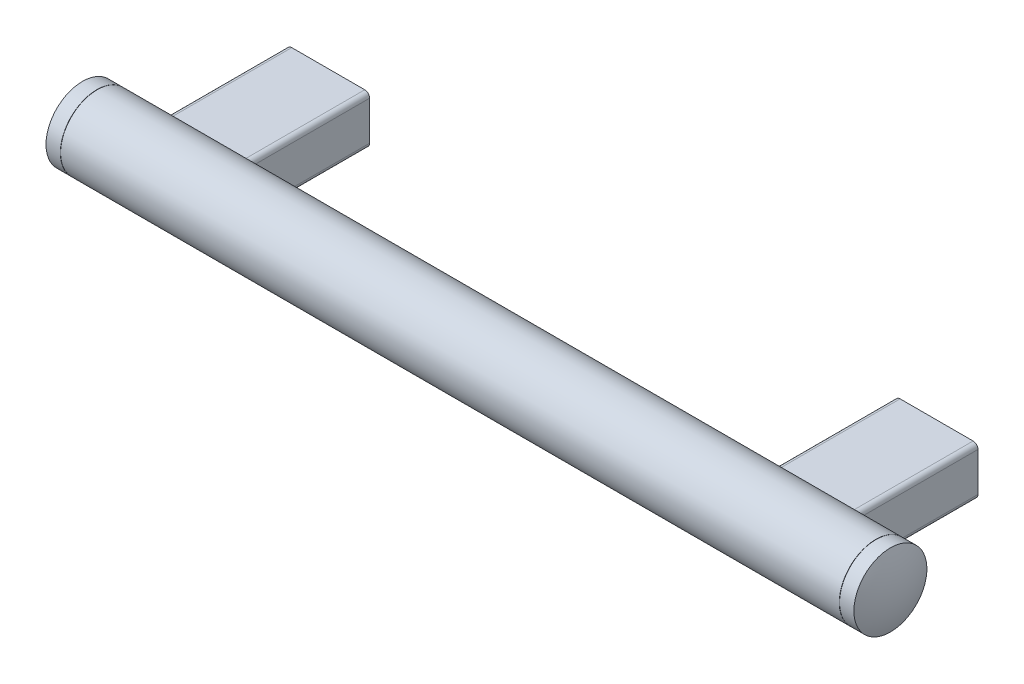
ISO-10303-21;
HEADER;
FILE_DESCRIPTION(('STEP AP214'),'2;1');
FILE_NAME('part.step','',(''),(''),'','','');
FILE_SCHEMA(('AUTOMOTIVE_DESIGN { 1 0 10303 214 1 1 1 1 }'));
ENDSEC;
DATA;
#1=APPLICATION_CONTEXT('core data for automotive mechanical design processes');
#2=APPLICATION_PROTOCOL_DEFINITION('international standard','automotive_design',2000,#1);
#3=PRODUCT_CONTEXT('',#1,'mechanical');
#4=PRODUCT('Part','Part','',(#3));
#5=PRODUCT_RELATED_PRODUCT_CATEGORY('part','',(#4));
#6=PRODUCT_DEFINITION_FORMATION('','',#4);
#7=PRODUCT_DEFINITION_CONTEXT('part definition',#1,'design');
#8=PRODUCT_DEFINITION('design','',#6,#7);
#9=PRODUCT_DEFINITION_SHAPE('','',#8);
#10=(LENGTH_UNIT() NAMED_UNIT(*) SI_UNIT(.MILLI.,.METRE.));
#11=(NAMED_UNIT(*) PLANE_ANGLE_UNIT() SI_UNIT($,.RADIAN.));
#12=(NAMED_UNIT(*) SI_UNIT($,.STERADIAN.) SOLID_ANGLE_UNIT());
#13=UNCERTAINTY_MEASURE_WITH_UNIT(LENGTH_MEASURE(1.E-05),#10,'distance_accuracy_value','');
#14=(GEOMETRIC_REPRESENTATION_CONTEXT(3) GLOBAL_UNCERTAINTY_ASSIGNED_CONTEXT((#13)) GLOBAL_UNIT_ASSIGNED_CONTEXT((#10,
#11,#12)) REPRESENTATION_CONTEXT('',''));
#15=CARTESIAN_POINT('',(0.,0.,0.));
#16=DIRECTION('',(0.,0.,1.));
#17=DIRECTION('',(1.,0.,0.));
#18=AXIS2_PLACEMENT_3D('',#15,#16,#17);
#19=CARTESIAN_POINT('',(0.,0.,17.));
#20=DIRECTION('',(0.,0.,-1.));
#21=DIRECTION('',(0.,1.,0.));
#22=AXIS2_PLACEMENT_3D('',#19,#20,#21);
#23=PLANE('',#22);
#24=CARTESIAN_POINT('',(0.,0.,17.));
#25=DIRECTION('',(0.,0.,-1.));
#26=DIRECTION('',(0.,1.,0.));
#27=AXIS2_PLACEMENT_3D('',#24,#25,#26);
#28=CIRCLE('',#27,3.);
#29=CARTESIAN_POINT('',(0.,3.,17.));
#30=VERTEX_POINT('',#29);
#31=EDGE_CURVE('E209',#30,#30,#28,.T.);
#32=ORIENTED_EDGE('',*,*,#31,.T.);
#33=EDGE_LOOP('',(#32));
#34=FACE_BOUND('',#33,.T.);
#35=ADVANCED_FACE('F14',(#34),#23,.T.);
#36=CARTESIAN_POINT('',(-5.,0.,60.));
#37=DIRECTION('',(1.,0.,0.));
#38=DIRECTION('',(0.,0.,1.));
#39=AXIS2_PLACEMENT_3D('',#36,#37,#38);
#40=SPHERICAL_SURFACE('',#39,39.);
#41=CARTESIAN_POINT('',(-41.,-2.69034686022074E-13,60.));
#42=DIRECTION('',(1.,0.,0.));
#43=DIRECTION('',(0.,1.,0.));
#44=AXIS2_PLACEMENT_3D('',#41,#42,#43);
#45=CIRCLE('',#44,15.);
#46=CARTESIAN_POINT('',(-41.0000000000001,14.9999999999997,60.));
#47=VERTEX_POINT('',#46);
#48=EDGE_CURVE('E322',#47,#47,#45,.T.);
#49=ORIENTED_EDGE('',*,*,#48,.F.);
#50=EDGE_LOOP('',(#49));
#51=FACE_BOUND('',#50,.T.);
#52=ADVANCED_FACE('F16',(#51),#40,.T.);
#53=CARTESIAN_POINT('',(0.,0.,17.));
#54=DIRECTION('',(0.,0.,-1.));
#55=DIRECTION('',(0.,1.,0.));
#56=AXIS2_PLACEMENT_3D('',#53,#54,#55);
#57=CYLINDRICAL_SURFACE('',#56,3.);
#58=ORIENTED_EDGE('',*,*,#31,.F.);
#59=EDGE_LOOP('',(#58));
#60=FACE_BOUND('',#59,.T.);
#61=CARTESIAN_POINT('',(0.,0.,0.));
#62=DIRECTION('',(0.,0.,-1.));
#63=DIRECTION('',(0.,1.,0.));
#64=AXIS2_PLACEMENT_3D('',#61,#62,#63);
#65=CIRCLE('',#64,3.);
#66=CARTESIAN_POINT('',(0.,3.,0.));
#67=VERTEX_POINT('',#66);
#68=EDGE_CURVE('E206',#67,#67,#65,.T.);
#69=ORIENTED_EDGE('',*,*,#68,.T.);
#70=EDGE_LOOP('',(#69));
#71=FACE_BOUND('',#70,.T.);
#72=ADVANCED_FACE('F342',(#60,#71),#57,.F.);
#73=CARTESIAN_POINT('',(-35.,-2.27871649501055E-13,60.));
#74=DIRECTION('',(1.,0.,0.));
#75=DIRECTION('',(0.,1.,0.));
#76=AXIS2_PLACEMENT_3D('',#73,#74,#75);
#77=CYLINDRICAL_SURFACE('',#76,15.);
#78=CARTESIAN_POINT('',(-35.1,-2.28557700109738E-13,60.));
#79=DIRECTION('',(-1.,0.,0.));
#80=DIRECTION('',(0.,-1.,0.));
#81=AXIS2_PLACEMENT_3D('',#78,#79,#80);
#82=CIRCLE('',#81,15.);
#83=CARTESIAN_POINT('',(-35.0999999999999,-15.0000000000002,60.));
#84=VERTEX_POINT('',#83);
#85=EDGE_CURVE('E9',#84,#84,#82,.T.);
#86=ORIENTED_EDGE('',*,*,#85,.T.);
#87=EDGE_LOOP('',(#86));
#88=FACE_BOUND('',#87,.T.);
#89=ORIENTED_EDGE('',*,*,#48,.T.);
#90=EDGE_LOOP('',(#89));
#91=FACE_BOUND('',#90,.T.);
#92=ADVANCED_FACE('F332',(#88,#91),#77,.T.);
#93=CARTESIAN_POINT('',(15.,8.0000000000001,0.));
#94=DIRECTION('',(0.,0.,-1.));
#95=DIRECTION('',(1.,0.,0.));
#96=AXIS2_PLACEMENT_3D('',#93,#94,#95);
#97=PLANE('',#96);
#98=ORIENTED_EDGE('',*,*,#68,.F.);
#99=EDGE_LOOP('',(#98));
#100=FACE_BOUND('',#99,.T.);
#101=CARTESIAN_POINT('',(15.,8.0000000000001,0.));
#102=DIRECTION('',(0.,0.,-1.));
#103=DIRECTION('',(1.,0.,0.));
#104=AXIS2_PLACEMENT_3D('',#101,#102,#103);
#105=CIRCLE('',#104,2.);
#106=CARTESIAN_POINT('',(15.,10.,0.));
#107=VERTEX_POINT('',#106);
#108=CARTESIAN_POINT('',(17.,8.00000000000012,0.));
#109=VERTEX_POINT('',#108);
#110=EDGE_CURVE('E212',#107,#109,#105,.T.);
#111=ORIENTED_EDGE('',*,*,#110,.T.);
#112=DIRECTION('',(0.,-1.,0.));
#113=VECTOR('',#112,1.);
#114=CARTESIAN_POINT('',(17.,8.00000000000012,0.));
#115=LINE('',#114,#113);
#116=CARTESIAN_POINT('',(17.,-7.99999999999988,0.));
#117=VERTEX_POINT('',#116);
#118=EDGE_CURVE('E226',#109,#117,#115,.T.);
#119=ORIENTED_EDGE('',*,*,#118,.T.);
#120=CARTESIAN_POINT('',(15.,-7.9999999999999,0.));
#121=DIRECTION('',(0.,0.,-1.));
#122=DIRECTION('',(1.,0.,0.));
#123=AXIS2_PLACEMENT_3D('',#120,#121,#122);
#124=CIRCLE('',#123,2.);
#125=CARTESIAN_POINT('',(15.,-10.,0.));
#126=VERTEX_POINT('',#125);
#127=EDGE_CURVE('E224',#117,#126,#124,.T.);
#128=ORIENTED_EDGE('',*,*,#127,.T.);
#129=DIRECTION('',(-1.,0.,0.));
#130=VECTOR('',#129,1.);
#131=CARTESIAN_POINT('',(15.,-10.,0.));
#132=LINE('',#131,#130);
#133=CARTESIAN_POINT('',(-15.,-10.,0.));
#134=VERTEX_POINT('',#133);
#135=EDGE_CURVE('E222',#126,#134,#132,.T.);
#136=ORIENTED_EDGE('',*,*,#135,.T.);
#137=CARTESIAN_POINT('',(-15.,-8.0000000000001,0.));
#138=DIRECTION('',(0.,0.,-1.));
#139=DIRECTION('',(1.,0.,0.));
#140=AXIS2_PLACEMENT_3D('',#137,#138,#139);
#141=CIRCLE('',#140,2.);
#142=CARTESIAN_POINT('',(-17.,-8.00000000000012,0.));
#143=VERTEX_POINT('',#142);
#144=EDGE_CURVE('E220',#134,#143,#141,.T.);
#145=ORIENTED_EDGE('',*,*,#144,.T.);
#146=DIRECTION('',(0.,1.,0.));
#147=VECTOR('',#146,1.);
#148=CARTESIAN_POINT('',(-17.,-8.00000000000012,0.));
#149=LINE('',#148,#147);
#150=CARTESIAN_POINT('',(-17.,7.99999999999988,0.));
#151=VERTEX_POINT('',#150);
#152=EDGE_CURVE('E218',#143,#151,#149,.T.);
#153=ORIENTED_EDGE('',*,*,#152,.T.);
#154=CARTESIAN_POINT('',(-15.,7.9999999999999,0.));
#155=DIRECTION('',(0.,0.,-1.));
#156=DIRECTION('',(1.,0.,0.));
#157=AXIS2_PLACEMENT_3D('',#154,#155,#156);
#158=CIRCLE('',#157,2.);
#159=CARTESIAN_POINT('',(-15.,10.,0.));
#160=VERTEX_POINT('',#159);
#161=EDGE_CURVE('E216',#151,#160,#158,.T.);
#162=ORIENTED_EDGE('',*,*,#161,.T.);
#163=DIRECTION('',(1.,0.,0.));
#164=VECTOR('',#163,1.);
#165=CARTESIAN_POINT('',(-15.,10.,0.));
#166=LINE('',#165,#164);
#167=EDGE_CURVE('E213',#160,#107,#166,.T.);
#168=ORIENTED_EDGE('',*,*,#167,.T.);
#169=EDGE_LOOP('',(#111,#119,#128,#136,#145,#153,#162,#168));
#170=FACE_BOUND('',#169,.T.);
#171=ADVANCED_FACE('F330',(#100,#170),#97,.T.);
#172=CARTESIAN_POINT('',(-35.,-2.27871649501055E-13,60.));
#173=DIRECTION('',(-1.,0.,0.));
#174=DIRECTION('',(0.,-1.,0.));
#175=AXIS2_PLACEMENT_3D('',#172,#173,#174);
#176=CONICAL_SURFACE('',#175,14.9,0.785398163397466);
#177=ORIENTED_EDGE('',*,*,#85,.F.);
#178=EDGE_LOOP('',(#177));
#179=FACE_BOUND('',#178,.T.);
#180=CARTESIAN_POINT('',(-35.,-2.27871649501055E-13,60.));
#181=DIRECTION('',(-1.,0.,0.));
#182=DIRECTION('',(0.,-1.,0.));
#183=AXIS2_PLACEMENT_3D('',#180,#181,#182);
#184=CIRCLE('',#183,14.9);
#185=CARTESIAN_POINT('',(-34.9999999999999,-14.9000000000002,60.));
#186=VERTEX_POINT('',#185);
#187=EDGE_CURVE('E22',#186,#186,#184,.F.);
#188=ORIENTED_EDGE('',*,*,#187,.F.);
#189=EDGE_LOOP('',(#188));
#190=FACE_BOUND('',#189,.T.);
#191=ADVANCED_FACE('F308',(#179,#190),#176,.T.);
#192=CARTESIAN_POINT('',(15.,-7.9999999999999,0.));
#193=DIRECTION('',(0.,0.,1.));
#194=DIRECTION('',(-1.,0.,0.));
#195=AXIS2_PLACEMENT_3D('',#192,#193,#194);
#196=CYLINDRICAL_SURFACE('',#195,2.);
#197=CARTESIAN_POINT('',(13.,-7.99999999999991,47.3114224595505));
#198=CARTESIAN_POINT('',(13.0000023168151,-8.14386139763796,47.4021308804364));
#199=CARTESIAN_POINT('',(13.0155259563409,-8.28625788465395,47.4953643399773));
#200=CARTESIAN_POINT('',(13.0758229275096,-8.56371074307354,47.6837058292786));
#201=CARTESIAN_POINT('',(13.1206564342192,-8.69875139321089,47.7788173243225));
#202=CARTESIAN_POINT('',(13.2349554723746,-8.95003632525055,47.9617438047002));
#203=CARTESIAN_POINT('',(13.3028588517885,-9.06691465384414,48.0496641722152));
#204=CARTESIAN_POINT('',(13.4631357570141,-9.28706267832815,48.2199435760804));
#205=CARTESIAN_POINT('',(13.5554607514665,-9.39035876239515,48.3023132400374));
#206=CARTESIAN_POINT('',(13.7336841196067,-9.55123394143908,48.4336095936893));
#207=CARTESIAN_POINT('',(13.8135167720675,-9.6133331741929,48.4852566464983));
#208=CARTESIAN_POINT('',(13.9850088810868,-9.72635405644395,48.5805658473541));
#209=CARTESIAN_POINT('',(14.0766503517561,-9.77729239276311,48.624239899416));
#210=CARTESIAN_POINT('',(14.2529034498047,-9.85726234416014,48.6935123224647));
#211=CARTESIAN_POINT('',(14.3357376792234,-9.88859638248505,48.720955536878));
#212=CARTESIAN_POINT('',(14.507188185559,-9.94039558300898,48.766579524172));
#213=CARTESIAN_POINT('',(14.5958003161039,-9.96086844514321,48.7847668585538));
#214=CARTESIAN_POINT('',(14.7770635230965,-9.98966321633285,48.8104058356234));
#215=CARTESIAN_POINT('',(14.8697344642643,-9.9979163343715,48.8177966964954));
#216=CARTESIAN_POINT('',(15.0555138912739,-10.0013851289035,48.8208987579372));
#217=CARTESIAN_POINT('',(15.1486222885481,-9.99660333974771,48.8166122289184));
#218=CARTESIAN_POINT('',(15.3236977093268,-9.97542143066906,48.7977175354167));
#219=CARTESIAN_POINT('',(15.4059092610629,-9.96011451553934,48.7840808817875));
#220=CARTESIAN_POINT('',(15.5660895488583,-9.91999093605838,48.7485782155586));
#221=CARTESIAN_POINT('',(15.6440574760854,-9.89517246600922,48.7267106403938));
#222=CARTESIAN_POINT('',(15.7999821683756,-9.83508027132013,48.674237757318));
#223=CARTESIAN_POINT('',(15.8775130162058,-9.79916985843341,48.6431064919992));
#224=CARTESIAN_POINT('',(16.0253011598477,-9.71925283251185,48.5746377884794));
#225=CARTESIAN_POINT('',(16.0955525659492,-9.67523974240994,48.5372953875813));
#226=CARTESIAN_POINT('',(16.2620749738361,-9.55636990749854,48.4378021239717));
#227=CARTESIAN_POINT('',(16.353495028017,-9.47718432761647,48.3726678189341));
#228=CARTESIAN_POINT('',(16.518627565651,-9.30686163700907,48.2358889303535));
#229=CARTESIAN_POINT('',(16.5923103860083,-9.21570489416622,48.1642337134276));
#230=CARTESIAN_POINT('',(16.7227715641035,-9.02265032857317,48.0163959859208));
#231=CARTESIAN_POINT('',(16.7792895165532,-8.9206160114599,47.940162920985));
#232=CARTESIAN_POINT('',(16.8736458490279,-8.70912728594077,47.7865564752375));
#233=CARTESIAN_POINT('',(16.9114866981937,-8.5996738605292,47.7091832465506));
#234=CARTESIAN_POINT('',(16.9722292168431,-8.35796248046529,47.543311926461));
#235=CARTESIAN_POINT('',(16.9919212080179,-8.22479320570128,47.4549411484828));
#236=CARTESIAN_POINT('',(17.0040509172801,-7.95466925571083,47.2819435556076));
#237=CARTESIAN_POINT('',(16.9964773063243,-7.81771303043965,47.1973183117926));
#238=CARTESIAN_POINT('',(16.9529013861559,-7.5479211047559,47.0364770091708));
#239=CARTESIAN_POINT('',(16.9176078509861,-7.4150673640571,46.960104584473));
#240=CARTESIAN_POINT('',(16.8182830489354,-7.15555538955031,46.8159187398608));
#241=CARTESIAN_POINT('',(16.7542827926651,-7.02889063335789,46.7480961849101));
#242=CARTESIAN_POINT('',(16.6077870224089,-6.80389422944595,46.631341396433));
#243=CARTESIAN_POINT('',(16.5287203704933,-6.70401274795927,46.5811018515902));
#244=CARTESIAN_POINT('',(16.3502883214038,-6.51906286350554,46.4902837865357));
#245=CARTESIAN_POINT('',(16.2509443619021,-6.43397899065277,46.449695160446));
#246=CARTESIAN_POINT('',(16.0496639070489,-6.29378739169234,46.3840743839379));
#247=CARTESIAN_POINT('',(15.9499072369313,-6.23617899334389,46.3576788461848));
#248=CARTESIAN_POINT('',(15.7404007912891,-6.13851290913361,46.3134536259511));
#249=CARTESIAN_POINT('',(15.6306571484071,-6.09844453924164,46.2956187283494));
#250=CARTESIAN_POINT('',(15.4147576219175,-6.04056991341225,46.2700171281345));
#251=CARTESIAN_POINT('',(15.3091262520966,-6.0211242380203,46.2615068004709));
#252=CARTESIAN_POINT('',(15.0957874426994,-5.99942292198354,46.2520156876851));
#253=CARTESIAN_POINT('',(14.9880805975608,-5.99716243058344,46.2510327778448));
#254=CARTESIAN_POINT('',(14.7777746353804,-6.00969461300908,46.2565067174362));
#255=CARTESIAN_POINT('',(14.6751312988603,-6.02387585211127,46.2626968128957));
#256=CARTESIAN_POINT('',(14.4738867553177,-6.06769355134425,46.281994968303));
#257=CARTESIAN_POINT('',(14.3752853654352,-6.09732931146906,46.2951027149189));
#258=CARTESIAN_POINT('',(14.1842523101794,-6.1710398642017,46.3281349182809));
#259=CARTESIAN_POINT('',(14.0918564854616,-6.21519107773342,46.3480954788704));
#260=CARTESIAN_POINT('',(13.9160688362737,-6.3161436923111,46.3945082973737));
#261=CARTESIAN_POINT('',(13.8326780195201,-6.37294650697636,46.4209612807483));
#262=CARTESIAN_POINT('',(13.6732429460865,-6.49982014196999,46.481218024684));
#263=CARTESIAN_POINT('',(13.5976745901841,-6.57035979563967,46.5152909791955));
#264=CARTESIAN_POINT('',(13.4595254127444,-6.72041002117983,46.5894410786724));
#265=CARTESIAN_POINT('',(13.3969495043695,-6.79992396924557,46.6295204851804));
#266=CARTESIAN_POINT('',(13.2808729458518,-6.97225102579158,46.7185142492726));
#267=CARTESIAN_POINT('',(13.2285510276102,-7.06562015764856,46.7678851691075));
#268=CARTESIAN_POINT('',(13.1401606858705,-7.25695759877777,46.8718461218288));
#269=CARTESIAN_POINT('',(13.1040923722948,-7.35492593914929,46.9264361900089));
#270=CARTESIAN_POINT('',(13.0503538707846,-7.54425766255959,47.0348536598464));
#271=CARTESIAN_POINT('',(13.0313508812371,-7.63544968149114,47.08833048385));
#272=CARTESIAN_POINT('',(13.0061708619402,-7.81795534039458,47.1980102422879));
#273=CARTESIAN_POINT('',(12.9999985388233,-7.90926901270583,47.2542141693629));
#274=CARTESIAN_POINT('',(13.,-7.99999999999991,47.3114224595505));
#275=B_SPLINE_CURVE_WITH_KNOTS('',3,(#197,#198,#199,#200,#201,#202,#203,#204,#205,#206,#207,
#208,#209,#210,#211,#212,#213,#214,#215,#216,#217,#218,#219,#220,#221,#222,#223,#224,#225,#226,
#227,#228,#229,#230,#231,#232,#233,#234,#235,#236,#237,#238,#239,#240,#241,#242,#243,#244,#245,
#246,#247,#248,#249,#250,#251,#252,#253,#254,#255,#256,#257,#258,#259,#260,#261,#262,#263,#264,
#265,#266,#267,#268,#269,#270,#271,#272,#273,#274),.UNSPECIFIED.,.T.,.F.,(4,2,2,2,2,2,2,2,2,2,2,
2,2,2,2,2,2,2,2,2,2,2,2,2,2,2,2,2,2,2,2,2,2,2,2,2,2,2,4),(0.,0.50977099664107,1.02059188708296,
1.50208208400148,1.98262254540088,2.32213593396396,2.66113819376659,2.93816857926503,
3.21500230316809,3.4933886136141,3.77172080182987,4.02480636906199,4.27794000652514,
4.54976470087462,4.82180763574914,5.23168501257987,5.6422431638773,6.05875006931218,
6.47520189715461,6.95596901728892,7.43693592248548,7.90599013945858,8.37453887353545,
8.78294034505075,9.19091226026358,9.54354102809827,9.89595470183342,10.2175724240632,
10.5390993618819,10.8490427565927,11.1589721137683,11.4705600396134,11.7821827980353,
12.1073297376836,12.4325994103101,12.7847727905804,13.1369485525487,13.4583347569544,
13.7798388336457),.UNSPECIFIED.);
#276=CARTESIAN_POINT('',(15.,-10.,48.819660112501));
#277=VERTEX_POINT('',#276);
#278=CARTESIAN_POINT('',(17.,-7.99999999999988,47.3114224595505));
#279=VERTEX_POINT('',#278);
#280=EDGE_CURVE('E296',#277,#279,#275,.T.);
#281=ORIENTED_EDGE('',*,*,#280,.F.);
#282=DIRECTION('',(0.,0.,1.));
#283=VECTOR('',#282,1.);
#284=CARTESIAN_POINT('',(15.,-10.,0.));
#285=LINE('',#284,#283);
#286=EDGE_CURVE('E236',#126,#277,#285,.T.);
#287=ORIENTED_EDGE('',*,*,#286,.F.);
#288=ORIENTED_EDGE('',*,*,#127,.F.);
#289=DIRECTION('',(0.,0.,1.));
#290=VECTOR('',#289,1.);
#291=CARTESIAN_POINT('',(17.,-7.99999999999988,0.));
#292=LINE('',#291,#290);
#293=EDGE_CURVE('E233',#117,#279,#292,.T.);
#294=ORIENTED_EDGE('',*,*,#293,.T.);
#295=EDGE_LOOP('',(#281,#287,#288,#294));
#296=FACE_BOUND('',#295,.T.);
#297=ADVANCED_FACE('F304',(#296),#196,.T.);
#298=CARTESIAN_POINT('',(15.,-10.,0.));
#299=DIRECTION('',(0.,1.,0.));
#300=DIRECTION('',(1.,0.,0.));
#301=AXIS2_PLACEMENT_3D('',#298,#299,#300);
#302=PLANE('',#301);
#303=DIRECTION('',(1.,0.,0.));
#304=VECTOR('',#303,1.);
#305=CARTESIAN_POINT('',(-35.,-10.0000000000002,48.819660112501));
#306=LINE('',#305,#304);
#307=CARTESIAN_POINT('',(-15.,-10.,48.8196601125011));
#308=VERTEX_POINT('',#307);
#309=EDGE_CURVE('E293',#308,#277,#306,.T.);
#310=ORIENTED_EDGE('',*,*,#309,.F.);
#311=DIRECTION('',(0.,0.,1.));
#312=VECTOR('',#311,1.);
#313=CARTESIAN_POINT('',(-15.,-10.,0.));
#314=LINE('',#313,#312);
#315=EDGE_CURVE('E239',#134,#308,#314,.T.);
#316=ORIENTED_EDGE('',*,*,#315,.F.);
#317=ORIENTED_EDGE('',*,*,#135,.F.);
#318=ORIENTED_EDGE('',*,*,#286,.T.);
#319=EDGE_LOOP('',(#310,#316,#317,#318));
#320=FACE_BOUND('',#319,.T.);
#321=ADVANCED_FACE('F284',(#320),#302,.F.);
#322=CARTESIAN_POINT('',(-15.,-8.0000000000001,0.));
#323=DIRECTION('',(0.,0.,1.));
#324=DIRECTION('',(-1.,0.,0.));
#325=AXIS2_PLACEMENT_3D('',#322,#323,#324);
#326=CYLINDRICAL_SURFACE('',#325,2.);
#327=CARTESIAN_POINT('',(-17.,-8.00000000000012,47.3114224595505));
#328=CARTESIAN_POINT('',(-16.9999976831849,-8.14386139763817,47.4021308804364));
#329=CARTESIAN_POINT('',(-16.9844740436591,-8.28625788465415,47.4953643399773));
#330=CARTESIAN_POINT('',(-16.9241770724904,-8.56371074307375,47.6837058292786));
#331=CARTESIAN_POINT('',(-16.8793435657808,-8.69875139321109,47.7788173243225));
#332=CARTESIAN_POINT('',(-16.7650445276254,-8.95003632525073,47.9617438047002));
#333=CARTESIAN_POINT('',(-16.6971411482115,-9.06691465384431,48.0496641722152));
#334=CARTESIAN_POINT('',(-16.5368642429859,-9.28706267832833,48.2199435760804));
#335=CARTESIAN_POINT('',(-16.4445392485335,-9.39035876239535,48.3023132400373));
#336=CARTESIAN_POINT('',(-16.2663158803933,-9.55123394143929,48.4336095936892));
#337=CARTESIAN_POINT('',(-16.1864832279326,-9.61333317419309,48.4852566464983));
#338=CARTESIAN_POINT('',(-16.0149911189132,-9.72635405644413,48.5805658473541));
#339=CARTESIAN_POINT('',(-15.9233496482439,-9.77729239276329,48.624239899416));
#340=CARTESIAN_POINT('',(-15.7470965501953,-9.85726234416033,48.6935123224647));
#341=CARTESIAN_POINT('',(-15.6642623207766,-9.88859638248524,48.720955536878));
#342=CARTESIAN_POINT('',(-15.492811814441,-9.94039558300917,48.7665795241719));
#343=CARTESIAN_POINT('',(-15.4041996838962,-9.96086844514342,48.7847668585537));
#344=CARTESIAN_POINT('',(-15.2229364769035,-9.98966321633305,48.8104058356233));
#345=CARTESIAN_POINT('',(-15.1302655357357,-9.9979163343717,48.8177966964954));
#346=CARTESIAN_POINT('',(-14.9444861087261,-10.0013851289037,48.8208987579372));
#347=CARTESIAN_POINT('',(-14.8513777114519,-9.99660333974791,48.8166122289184));
#348=CARTESIAN_POINT('',(-14.6763022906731,-9.97542143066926,48.7977175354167));
#349=CARTESIAN_POINT('',(-14.5940907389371,-9.96011451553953,48.7840808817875));
#350=CARTESIAN_POINT('',(-14.4339104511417,-9.91999093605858,48.7485782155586));
#351=CARTESIAN_POINT('',(-14.3559425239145,-9.89517246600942,48.7267106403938));
#352=CARTESIAN_POINT('',(-14.2000178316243,-9.83508027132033,48.674237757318));
#353=CARTESIAN_POINT('',(-14.1224869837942,-9.7991698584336,48.6431064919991));
#354=CARTESIAN_POINT('',(-13.9746988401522,-9.71925283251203,48.5746377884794));
#355=CARTESIAN_POINT('',(-13.9044474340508,-9.67523974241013,48.5372953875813));
#356=CARTESIAN_POINT('',(-13.7379250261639,-9.55636990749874,48.4378021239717));
#357=CARTESIAN_POINT('',(-13.646504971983,-9.47718432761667,48.3726678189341));
#358=CARTESIAN_POINT('',(-13.481372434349,-9.30686163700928,48.2358889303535));
#359=CARTESIAN_POINT('',(-13.4076896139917,-9.21570489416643,48.1642337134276));
#360=CARTESIAN_POINT('',(-13.2772284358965,-9.02265032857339,48.0163959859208));
#361=CARTESIAN_POINT('',(-13.2207104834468,-8.92061601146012,47.9401629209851));
#362=CARTESIAN_POINT('',(-13.1263541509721,-8.70912728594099,47.7865564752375));
#363=CARTESIAN_POINT('',(-13.0885133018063,-8.59967386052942,47.7091832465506));
#364=CARTESIAN_POINT('',(-13.0277707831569,-8.35796248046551,47.543311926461));
#365=CARTESIAN_POINT('',(-13.0080787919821,-8.2247932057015,47.4549411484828));
#366=CARTESIAN_POINT('',(-12.9959490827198,-7.95466925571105,47.2819435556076));
#367=CARTESIAN_POINT('',(-13.0035226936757,-7.81771303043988,47.1973183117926));
#368=CARTESIAN_POINT('',(-13.0470986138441,-7.54792110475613,47.0364770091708));
#369=CARTESIAN_POINT('',(-13.0823921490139,-7.41506736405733,46.960104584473));
#370=CARTESIAN_POINT('',(-13.1817169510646,-7.15555538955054,46.8159187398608));
#371=CARTESIAN_POINT('',(-13.2457172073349,-7.02889063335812,46.7480961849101));
#372=CARTESIAN_POINT('',(-13.392212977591,-6.80389422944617,46.631341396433));
#373=CARTESIAN_POINT('',(-13.4712796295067,-6.70401274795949,46.5811018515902));
#374=CARTESIAN_POINT('',(-13.6497116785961,-6.51906286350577,46.4902837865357));
#375=CARTESIAN_POINT('',(-13.7490556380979,-6.433978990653,46.449695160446));
#376=CARTESIAN_POINT('',(-13.950336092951,-6.29378739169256,46.3840743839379));
#377=CARTESIAN_POINT('',(-14.0500927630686,-6.23617899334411,46.3576788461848));
#378=CARTESIAN_POINT('',(-14.2595992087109,-6.13851290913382,46.3134536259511));
#379=CARTESIAN_POINT('',(-14.3693428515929,-6.09844453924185,46.2956187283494));
#380=CARTESIAN_POINT('',(-14.5852423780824,-6.04056991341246,46.2700171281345));
#381=CARTESIAN_POINT('',(-14.6908737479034,-6.02112423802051,46.2615068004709));
#382=CARTESIAN_POINT('',(-14.9042125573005,-5.99942292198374,46.2520156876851));
#383=CARTESIAN_POINT('',(-15.0119194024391,-5.99716243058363,46.2510327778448));
#384=CARTESIAN_POINT('',(-15.2222253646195,-6.00969461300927,46.2565067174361));
#385=CARTESIAN_POINT('',(-15.3248687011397,-6.02387585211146,46.2626968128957));
#386=CARTESIAN_POINT('',(-15.5261132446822,-6.06769355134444,46.281994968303));
#387=CARTESIAN_POINT('',(-15.6247146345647,-6.09732931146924,46.2951027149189));
#388=CARTESIAN_POINT('',(-15.8157476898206,-6.17103986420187,46.3281349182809));
#389=CARTESIAN_POINT('',(-15.9081435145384,-6.21519107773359,46.3480954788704));
#390=CARTESIAN_POINT('',(-16.0839311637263,-6.31614369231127,46.3945082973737));
#391=CARTESIAN_POINT('',(-16.1673219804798,-6.37294650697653,46.4209612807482));
#392=CARTESIAN_POINT('',(-16.3267570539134,-6.49982014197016,46.4812180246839));
#393=CARTESIAN_POINT('',(-16.4023254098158,-6.57035979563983,46.5152909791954));
#394=CARTESIAN_POINT('',(-16.5404745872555,-6.72041002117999,46.5894410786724));
#395=CARTESIAN_POINT('',(-16.6030504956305,-6.79992396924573,46.6295204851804));
#396=CARTESIAN_POINT('',(-16.7191270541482,-6.97225102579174,46.7185142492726));
#397=CARTESIAN_POINT('',(-16.7714489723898,-7.06562015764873,46.7678851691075));
#398=CARTESIAN_POINT('',(-16.8598393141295,-7.25695759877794,46.8718461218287));
#399=CARTESIAN_POINT('',(-16.8959076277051,-7.35492593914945,46.9264361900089));
#400=CARTESIAN_POINT('',(-16.9496461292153,-7.54425766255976,47.0348536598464));
#401=CARTESIAN_POINT('',(-16.9686491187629,-7.63544968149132,47.08833048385));
#402=CARTESIAN_POINT('',(-16.9938291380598,-7.81795534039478,47.1980102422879));
#403=CARTESIAN_POINT('',(-17.0000014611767,-7.90926901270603,47.2542141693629));
#404=CARTESIAN_POINT('',(-17.,-8.00000000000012,47.3114224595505));
#405=B_SPLINE_CURVE_WITH_KNOTS('',3,(#327,#328,#329,#330,#331,#332,#333,#334,#335,#336,#337,
#338,#339,#340,#341,#342,#343,#344,#345,#346,#347,#348,#349,#350,#351,#352,#353,#354,#355,#356,
#357,#358,#359,#360,#361,#362,#363,#364,#365,#366,#367,#368,#369,#370,#371,#372,#373,#374,#375,
#376,#377,#378,#379,#380,#381,#382,#383,#384,#385,#386,#387,#388,#389,#390,#391,#392,#393,#394,
#395,#396,#397,#398,#399,#400,#401,#402,#403,#404),.UNSPECIFIED.,.T.,.F.,(4,2,2,2,2,2,2,2,2,2,2,
2,2,2,2,2,2,2,2,2,2,2,2,2,2,2,2,2,2,2,2,2,2,2,2,2,2,2,4),(0.,0.509770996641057,1.02059188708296,
1.50208208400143,1.98262254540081,2.32213593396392,2.66113819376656,2.93816857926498,
3.21500230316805,3.49338861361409,3.77172080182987,4.024806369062,4.27794000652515,
4.54976470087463,4.82180763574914,5.23168501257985,5.64224316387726,6.05875006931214,
6.47520189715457,6.95596901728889,7.43693592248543,7.90599013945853,8.37453887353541,
8.78294034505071,9.19091226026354,9.54354102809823,9.89595470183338,10.2175724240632,
10.5390993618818,10.8490427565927,11.1589721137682,11.4705600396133,11.7821827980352,
12.1073297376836,12.4325994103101,12.7847727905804,13.1369485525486,13.4583347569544,
13.7798388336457),.UNSPECIFIED.);
#406=CARTESIAN_POINT('',(-17.,-8.00000000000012,47.3114224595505));
#407=VERTEX_POINT('',#406);
#408=EDGE_CURVE('E287',#407,#308,#405,.T.);
#409=ORIENTED_EDGE('',*,*,#408,.F.);
#410=DIRECTION('',(0.,0.,1.));
#411=VECTOR('',#410,1.);
#412=CARTESIAN_POINT('',(-17.,-8.00000000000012,0.));
#413=LINE('',#412,#411);
#414=EDGE_CURVE('E242',#143,#407,#413,.T.);
#415=ORIENTED_EDGE('',*,*,#414,.F.);
#416=ORIENTED_EDGE('',*,*,#144,.F.);
#417=ORIENTED_EDGE('',*,*,#315,.T.);
#418=EDGE_LOOP('',(#409,#415,#416,#417));
#419=FACE_BOUND('',#418,.T.);
#420=ADVANCED_FACE('F279',(#419),#326,.T.);
#421=CARTESIAN_POINT('',(-17.,-8.00000000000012,0.));
#422=DIRECTION('',(1.,0.,0.));
#423=DIRECTION('',(0.,0.,1.));
#424=AXIS2_PLACEMENT_3D('',#421,#422,#423);
#425=PLANE('',#424);
#426=CARTESIAN_POINT('',(-17.,-1.18710434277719E-13,60.));
#427=DIRECTION('',(1.,0.,0.));
#428=DIRECTION('',(0.,0.,1.));
#429=AXIS2_PLACEMENT_3D('',#426,#427,#428);
#430=CIRCLE('',#429,15.);
#431=CARTESIAN_POINT('',(-17.,7.99999999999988,47.3114224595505));
#432=VERTEX_POINT('',#431);
#433=EDGE_CURVE('E263',#432,#407,#430,.F.);
#434=ORIENTED_EDGE('',*,*,#433,.F.);
#435=DIRECTION('',(0.,0.,1.));
#436=VECTOR('',#435,1.);
#437=CARTESIAN_POINT('',(-17.,7.99999999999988,0.));
#438=LINE('',#437,#436);
#439=EDGE_CURVE('E245',#151,#432,#438,.T.);
#440=ORIENTED_EDGE('',*,*,#439,.F.);
#441=ORIENTED_EDGE('',*,*,#152,.F.);
#442=ORIENTED_EDGE('',*,*,#414,.T.);
#443=EDGE_LOOP('',(#434,#440,#441,#442));
#444=FACE_BOUND('',#443,.T.);
#445=ADVANCED_FACE('F274',(#444),#425,.F.);
#446=CARTESIAN_POINT('',(-15.,7.9999999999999,0.));
#447=DIRECTION('',(0.,0.,1.));
#448=DIRECTION('',(-1.,0.,0.));
#449=AXIS2_PLACEMENT_3D('',#446,#447,#448);
#450=CYLINDRICAL_SURFACE('',#449,2.);
#451=CARTESIAN_POINT('',(-17.,7.99999999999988,47.3114224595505));
#452=CARTESIAN_POINT('',(-16.9999991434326,7.87909476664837,47.2351918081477));
#453=CARTESIAN_POINT('',(-16.9890388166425,7.75708923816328,47.1607041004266));
#454=CARTESIAN_POINT('',(-16.944013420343,7.51414460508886,47.0170299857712));
#455=CARTESIAN_POINT('',(-16.909954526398,7.39320522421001,46.9478421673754));
#456=CARTESIAN_POINT('',(-16.8175938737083,7.15580080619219,46.8161820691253));
#457=CARTESIAN_POINT('',(-16.7591388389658,7.03936923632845,46.7537554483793));
#458=CARTESIAN_POINT('',(-16.6180104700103,6.81706769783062,46.6379910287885));
#459=CARTESIAN_POINT('',(-16.5353548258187,6.71119009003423,46.5846466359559));
#460=CARTESIAN_POINT('',(-16.3589136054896,6.52774525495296,46.4945296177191));
#461=CARTESIAN_POINT('',(-16.2677073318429,6.44830074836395,46.4565302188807));
#462=CARTESIAN_POINT('',(-16.0701948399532,6.30605393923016,46.3897143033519));
#463=CARTESIAN_POINT('',(-15.9639012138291,6.24323788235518,46.3608901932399));
#464=CARTESIAN_POINT('',(-15.7525224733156,6.14371866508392,46.3157983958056));
#465=CARTESIAN_POINT('',(-15.6486727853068,6.10485920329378,46.298476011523));
#466=CARTESIAN_POINT('',(-15.4350253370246,6.04473842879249,46.2718452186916));
#467=CARTESIAN_POINT('',(-15.3252301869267,6.02346945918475,46.2625333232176));
#468=CARTESIAN_POINT('',(-15.1101174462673,6.00028628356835,46.2523925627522));
#469=CARTESIAN_POINT('',(-15.0049409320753,5.99726003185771,46.2510762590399));
#470=CARTESIAN_POINT('',(-14.795579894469,6.00771705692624,46.2556422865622));
#471=CARTESIAN_POINT('',(-14.6913952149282,6.02119769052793,46.2615234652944));
#472=CARTESIAN_POINT('',(-14.4886277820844,6.06374928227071,46.2802526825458));
#473=CARTESIAN_POINT('',(-14.3899832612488,6.09257556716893,46.2929914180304));
#474=CARTESIAN_POINT('',(-14.1992155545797,6.16447906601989,46.3251786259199));
#475=CARTESIAN_POINT('',(-14.1070926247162,6.20755683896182,46.3446273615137));
#476=CARTESIAN_POINT('',(-13.9295504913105,6.30744168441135,46.3904718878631));
#477=CARTESIAN_POINT('',(-13.8443382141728,6.36454602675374,46.417019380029));
#478=CARTESIAN_POINT('',(-13.6849200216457,6.48975291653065,46.4763947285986));
#479=CARTESIAN_POINT('',(-13.6107163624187,6.55785771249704,46.5092238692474));
#480=CARTESIAN_POINT('',(-13.4703450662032,6.7072135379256,46.5828236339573));
#481=CARTESIAN_POINT('',(-13.4049591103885,6.78901734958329,46.6239600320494));
#482=CARTESIAN_POINT('',(-13.288789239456,6.95960528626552,46.7119184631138));
#483=CARTESIAN_POINT('',(-13.2380106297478,7.04839193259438,46.7587425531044));
#484=CARTESIAN_POINT('',(-13.146904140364,7.23951560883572,46.8621785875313));
#485=CARTESIAN_POINT('',(-13.1081365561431,7.34231828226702,46.9193012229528));
#486=CARTESIAN_POINT('',(-13.0482089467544,7.55028832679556,47.0382283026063));
#487=CARTESIAN_POINT('',(-13.0270567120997,7.65545672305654,47.1000348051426));
#488=CARTESIAN_POINT('',(-13.0000866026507,7.87914859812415,47.2352758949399));
#489=CARTESIAN_POINT('',(-12.9965732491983,7.9976616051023,47.309187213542));
#490=CARTESIAN_POINT('',(-13.0100119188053,8.23176813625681,47.459768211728));
#491=CARTESIAN_POINT('',(-13.026978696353,8.34735949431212,47.5364398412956));
#492=CARTESIAN_POINT('',(-13.0835973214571,8.5867568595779,47.6999585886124));
#493=CARTESIAN_POINT('',(-13.1257113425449,8.70990049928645,47.786929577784));
#494=CARTESIAN_POINT('',(-13.2334577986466,8.9467076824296,47.9593245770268));
#495=CARTESIAN_POINT('',(-13.2990930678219,9.06037008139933,48.0447483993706));
#496=CARTESIAN_POINT('',(-13.4423655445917,9.25960123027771,48.1985889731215));
#497=CARTESIAN_POINT('',(-13.5169227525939,9.34685994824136,48.2676856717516));
#498=CARTESIAN_POINT('',(-13.6829377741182,9.50957472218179,48.3991861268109));
#499=CARTESIAN_POINT('',(-13.7743716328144,9.58504723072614,48.4615991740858));
#500=CARTESIAN_POINT('',(-13.9509067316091,9.70530243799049,48.5627005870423));
#501=CARTESIAN_POINT('',(-14.0326722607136,9.75315622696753,48.603550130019));
#502=CARTESIAN_POINT('',(-14.2053049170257,9.83784302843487,48.6765742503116));
#503=CARTESIAN_POINT('',(-14.296160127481,9.87469022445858,48.7087599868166));
#504=CARTESIAN_POINT('',(-14.4712701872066,9.9306990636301,48.758007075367));
#505=CARTESIAN_POINT('',(-14.554509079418,9.95167197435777,48.7766025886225));
#506=CARTESIAN_POINT('',(-14.7245244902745,9.98281750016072,48.8042955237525));
#507=CARTESIAN_POINT('',(-14.8112988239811,9.99299668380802,48.8133987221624));
#508=CARTESIAN_POINT('',(-14.9861247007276,10.0018703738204,48.8213315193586));
#509=CARTESIAN_POINT('',(-15.0741788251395,10.0005370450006,48.8201362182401));
#510=CARTESIAN_POINT('',(-15.2486141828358,9.98641726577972,48.8075224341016));
#511=CARTESIAN_POINT('',(-15.3349950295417,9.97362820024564,48.7961016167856));
#512=CARTESIAN_POINT('',(-15.5009447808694,9.93804813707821,48.7645323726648));
#513=CARTESIAN_POINT('',(-15.5806434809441,9.91559258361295,48.7446769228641));
#514=CARTESIAN_POINT('',(-15.7347280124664,9.86194601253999,48.6976421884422));
#515=CARTESIAN_POINT('',(-15.8091112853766,9.83075082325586,48.6704594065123));
#516=CARTESIAN_POINT('',(-15.9806238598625,9.74666189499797,48.5979492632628));
#517=CARTESIAN_POINT('',(-16.0747398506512,9.69009939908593,48.5497345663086));
#518=CARTESIAN_POINT('',(-16.2497262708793,9.56518206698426,48.4451760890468));
#519=CARTESIAN_POINT('',(-16.3305694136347,9.49680351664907,48.3888159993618));
#520=CARTESIAN_POINT('',(-16.497930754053,9.331678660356,48.2554817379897));
#521=CARTESIAN_POINT('',(-16.5804869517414,9.23217372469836,48.1769512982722));
#522=CARTESIAN_POINT('',(-16.7240153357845,9.02177052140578,48.0156229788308));
#523=CARTESIAN_POINT('',(-16.7849693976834,8.9108627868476,47.932821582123));
#524=CARTESIAN_POINT('',(-16.8890292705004,8.67085776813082,47.7590885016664));
#525=CARTESIAN_POINT('',(-16.9302441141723,8.54101472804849,47.6680503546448));
#526=CARTESIAN_POINT('',(-16.9857218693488,8.27458961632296,47.4877259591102));
#527=CARTESIAN_POINT('',(-17.0000009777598,8.13801164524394,47.3984386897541));
#528=CARTESIAN_POINT('',(-17.,7.99999999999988,47.3114224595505));
#529=B_SPLINE_CURVE_WITH_KNOTS('',3,(#451,#452,#453,#454,#455,#456,#457,#458,#459,#460,#461,
#462,#463,#464,#465,#466,#467,#468,#469,#470,#471,#472,#473,#474,#475,#476,#477,#478,#479,#480,
#481,#482,#483,#484,#485,#486,#487,#488,#489,#490,#491,#492,#493,#494,#495,#496,#497,#498,#499,
#500,#501,#502,#503,#504,#505,#506,#507,#508,#509,#510,#511,#512,#513,#514,#515,#516,#517,#518,
#519,#520,#521,#522,#523,#524,#525,#526,#527,#528),.UNSPECIFIED.,.T.,.F.,(4,2,2,2,2,2,2,2,2,2,2,
2,2,2,2,2,2,2,2,2,2,2,2,2,2,2,2,2,2,2,2,2,2,2,2,2,2,2,4),(0.,0.428302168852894,
0.856489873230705,1.28740928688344,1.71801449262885,2.09620696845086,2.47408563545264,
2.80902084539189,3.14381018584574,3.45796652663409,3.77207256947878,4.08131419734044,
4.39056795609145,4.70704747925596,5.02359177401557,5.35972890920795,5.69598797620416,
6.06599418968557,6.43616395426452,6.85362917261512,7.27139532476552,7.73894100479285,
8.206543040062,8.60695107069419,9.00679507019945,9.31517612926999,9.6231580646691,
9.88551744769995,10.1477170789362,10.4105508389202,10.6734446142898,10.9278702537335,
11.1824175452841,11.5402241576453,11.8987573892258,12.3502378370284,12.8020961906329,
13.2912914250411,13.7801924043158),.UNSPECIFIED.);
#530=CARTESIAN_POINT('',(-15.,10.,48.8196601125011));
#531=VERTEX_POINT('',#530);
#532=EDGE_CURVE('E255',#531,#432,#529,.T.);
#533=ORIENTED_EDGE('',*,*,#532,.F.);
#534=DIRECTION('',(0.,0.,1.));
#535=VECTOR('',#534,1.);
#536=CARTESIAN_POINT('',(-15.,10.,0.));
#537=LINE('',#536,#535);
#538=EDGE_CURVE('E29',#160,#531,#537,.T.);
#539=ORIENTED_EDGE('',*,*,#538,.F.);
#540=ORIENTED_EDGE('',*,*,#161,.F.);
#541=ORIENTED_EDGE('',*,*,#439,.T.);
#542=EDGE_LOOP('',(#533,#539,#540,#541));
#543=FACE_BOUND('',#542,.T.);
#544=ADVANCED_FACE('F268',(#543),#450,.T.);
#545=CARTESIAN_POINT('',(-15.,10.,0.));
#546=DIRECTION('',(0.,-1.,0.));
#547=DIRECTION('',(-1.,0.,0.));
#548=AXIS2_PLACEMENT_3D('',#545,#546,#547);
#549=PLANE('',#548);
#550=DIRECTION('',(1.,0.,0.));
#551=VECTOR('',#550,1.);
#552=CARTESIAN_POINT('',(-35.,9.99999999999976,48.8196601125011));
#553=LINE('',#552,#551);
#554=CARTESIAN_POINT('',(15.,10.,48.8196601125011));
#555=VERTEX_POINT('',#554);
#556=EDGE_CURVE('E252',#555,#531,#553,.F.);
#557=ORIENTED_EDGE('',*,*,#556,.F.);
#558=DIRECTION('',(0.,0.,1.));
#559=VECTOR('',#558,1.);
#560=CARTESIAN_POINT('',(15.,10.,0.));
#561=LINE('',#560,#559);
#562=EDGE_CURVE('E215',#107,#555,#561,.T.);
#563=ORIENTED_EDGE('',*,*,#562,.F.);
#564=ORIENTED_EDGE('',*,*,#167,.F.);
#565=ORIENTED_EDGE('',*,*,#538,.T.);
#566=EDGE_LOOP('',(#557,#563,#564,#565));
#567=FACE_BOUND('',#566,.T.);
#568=ADVANCED_FACE('F273',(#567),#549,.F.);
#569=CARTESIAN_POINT('',(15.,8.0000000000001,0.));
#570=DIRECTION('',(0.,0.,1.));
#571=DIRECTION('',(-1.,0.,0.));
#572=AXIS2_PLACEMENT_3D('',#569,#570,#571);
#573=CYLINDRICAL_SURFACE('',#572,2.);
#574=CARTESIAN_POINT('',(13.,8.00000000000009,47.3114224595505));
#575=CARTESIAN_POINT('',(13.0000008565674,7.87909476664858,47.2351918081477));
#576=CARTESIAN_POINT('',(13.0109611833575,7.75708923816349,47.1607041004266));
#577=CARTESIAN_POINT('',(13.055986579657,7.51414460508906,47.0170299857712));
#578=CARTESIAN_POINT('',(13.090045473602,7.39320522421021,46.9478421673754));
#579=CARTESIAN_POINT('',(13.1824061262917,7.15580080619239,46.8161820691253));
#580=CARTESIAN_POINT('',(13.2408611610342,7.03936923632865,46.7537554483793));
#581=CARTESIAN_POINT('',(13.3819895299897,6.81706769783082,46.6379910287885));
#582=CARTESIAN_POINT('',(13.4646451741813,6.71119009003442,46.5846466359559));
#583=CARTESIAN_POINT('',(13.6410863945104,6.52774525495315,46.4945296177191));
#584=CARTESIAN_POINT('',(13.7322926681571,6.44830074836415,46.4565302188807));
#585=CARTESIAN_POINT('',(13.9298051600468,6.30605393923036,46.3897143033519));
#586=CARTESIAN_POINT('',(14.0360987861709,6.24323788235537,46.3608901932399));
#587=CARTESIAN_POINT('',(14.2474775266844,6.14371866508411,46.3157983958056));
#588=CARTESIAN_POINT('',(14.3513272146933,6.10485920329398,46.298476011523));
#589=CARTESIAN_POINT('',(14.5649746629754,6.04473842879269,46.2718452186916));
#590=CARTESIAN_POINT('',(14.6747698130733,6.02346945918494,46.2625333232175));
#591=CARTESIAN_POINT('',(14.8898825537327,6.00028628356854,46.2523925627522));
#592=CARTESIAN_POINT('',(14.9950590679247,5.99726003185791,46.2510762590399));
#593=CARTESIAN_POINT('',(15.204420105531,6.00771705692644,46.2556422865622));
#594=CARTESIAN_POINT('',(15.3086047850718,6.02119769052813,46.2615234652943));
#595=CARTESIAN_POINT('',(15.5113722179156,6.06374928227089,46.2802526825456));
#596=CARTESIAN_POINT('',(15.6100167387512,6.09257556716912,46.2929914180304));
#597=CARTESIAN_POINT('',(15.8007844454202,6.16447906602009,46.3251786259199));
#598=CARTESIAN_POINT('',(15.8929073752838,6.20755683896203,46.3446273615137));
#599=CARTESIAN_POINT('',(16.0704495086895,6.30744168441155,46.3904718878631));
#600=CARTESIAN_POINT('',(16.1556617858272,6.36454602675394,46.417019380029));
#601=CARTESIAN_POINT('',(16.3150799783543,6.48975291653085,46.4763947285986));
#602=CARTESIAN_POINT('',(16.3892836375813,6.55785771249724,46.5092238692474));
#603=CARTESIAN_POINT('',(16.5296549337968,6.7072135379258,46.5828236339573));
#604=CARTESIAN_POINT('',(16.5950408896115,6.78901734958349,46.6239600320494));
#605=CARTESIAN_POINT('',(16.711210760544,6.95960528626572,46.7119184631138));
#606=CARTESIAN_POINT('',(16.7619893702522,7.04839193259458,46.7587425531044));
#607=CARTESIAN_POINT('',(16.853095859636,7.23951560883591,46.8621785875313));
#608=CARTESIAN_POINT('',(16.8918634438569,7.34231828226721,46.9193012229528));
#609=CARTESIAN_POINT('',(16.9517910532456,7.55028832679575,47.0382283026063));
#610=CARTESIAN_POINT('',(16.9729432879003,7.65545672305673,47.1000348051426));
#611=CARTESIAN_POINT('',(16.9999133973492,7.87914859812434,47.23527589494));
#612=CARTESIAN_POINT('',(17.0034267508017,7.9976616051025,47.309187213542));
#613=CARTESIAN_POINT('',(16.9899880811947,8.23176813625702,47.4597682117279));
#614=CARTESIAN_POINT('',(16.9730213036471,8.34735949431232,47.5364398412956));
#615=CARTESIAN_POINT('',(16.9164026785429,8.5867568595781,47.6999585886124));
#616=CARTESIAN_POINT('',(16.8742886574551,8.70990049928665,47.786929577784));
#617=CARTESIAN_POINT('',(16.7665422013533,8.94670768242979,47.9593245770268));
#618=CARTESIAN_POINT('',(16.7009069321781,9.06037008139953,48.0447483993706));
#619=CARTESIAN_POINT('',(16.5576344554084,9.2596012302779,48.1985889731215));
#620=CARTESIAN_POINT('',(16.4830772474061,9.34685994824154,48.2676856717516));
#621=CARTESIAN_POINT('',(16.3170622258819,9.50957472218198,48.3991861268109));
#622=CARTESIAN_POINT('',(16.2256283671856,9.58504723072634,48.4615991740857));
#623=CARTESIAN_POINT('',(16.0490932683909,9.7053024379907,48.5627005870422));
#624=CARTESIAN_POINT('',(15.9673277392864,9.75315622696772,48.603550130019));
#625=CARTESIAN_POINT('',(15.7946950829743,9.83784302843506,48.6765742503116));
#626=CARTESIAN_POINT('',(15.7038398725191,9.87469022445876,48.7087599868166));
#627=CARTESIAN_POINT('',(15.5287298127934,9.93069906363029,48.758007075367));
#628=CARTESIAN_POINT('',(15.445490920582,9.95167197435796,48.7766025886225));
#629=CARTESIAN_POINT('',(15.2754755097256,9.98281750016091,48.8042955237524));
#630=CARTESIAN_POINT('',(15.188701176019,9.99299668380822,48.8133987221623));
#631=CARTESIAN_POINT('',(15.0138752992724,10.0018703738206,48.8213315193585));
#632=CARTESIAN_POINT('',(14.9258211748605,10.0005370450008,48.8201362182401));
#633=CARTESIAN_POINT('',(14.7513858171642,9.98641726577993,48.8075224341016));
#634=CARTESIAN_POINT('',(14.6650049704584,9.97362820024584,48.7961016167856));
#635=CARTESIAN_POINT('',(14.4990552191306,9.93804813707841,48.7645323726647));
#636=CARTESIAN_POINT('',(14.4193565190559,9.91559258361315,48.7446769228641));
#637=CARTESIAN_POINT('',(14.2652719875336,9.86194601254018,48.6976421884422));
#638=CARTESIAN_POINT('',(14.1908887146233,9.83075082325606,48.6704594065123));
#639=CARTESIAN_POINT('',(14.0193761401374,9.74666189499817,48.5979492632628));
#640=CARTESIAN_POINT('',(13.9252601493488,9.69009939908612,48.5497345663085));
#641=CARTESIAN_POINT('',(13.7502737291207,9.56518206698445,48.4451760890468));
#642=CARTESIAN_POINT('',(13.6694305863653,9.49680351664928,48.3888159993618));
#643=CARTESIAN_POINT('',(13.5020692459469,9.33167866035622,48.2554817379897));
#644=CARTESIAN_POINT('',(13.4195130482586,9.23217372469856,48.1769512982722));
#645=CARTESIAN_POINT('',(13.2759846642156,9.02177052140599,48.0156229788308));
#646=CARTESIAN_POINT('',(13.2150306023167,8.91086278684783,47.932821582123));
#647=CARTESIAN_POINT('',(13.1109707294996,8.67085776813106,47.7590885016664));
#648=CARTESIAN_POINT('',(13.0697558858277,8.54101472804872,47.6680503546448));
#649=CARTESIAN_POINT('',(13.0142781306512,8.27458961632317,47.4877259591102));
#650=CARTESIAN_POINT('',(12.9999990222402,8.13801164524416,47.3984386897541));
#651=CARTESIAN_POINT('',(13.,8.00000000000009,47.3114224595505));
#652=B_SPLINE_CURVE_WITH_KNOTS('',3,(#574,#575,#576,#577,#578,#579,#580,#581,#582,#583,#584,
#585,#586,#587,#588,#589,#590,#591,#592,#593,#594,#595,#596,#597,#598,#599,#600,#601,#602,#603,
#604,#605,#606,#607,#608,#609,#610,#611,#612,#613,#614,#615,#616,#617,#618,#619,#620,#621,#622,
#623,#624,#625,#626,#627,#628,#629,#630,#631,#632,#633,#634,#635,#636,#637,#638,#639,#640,#641,
#642,#643,#644,#645,#646,#647,#648,#649,#650,#651),.UNSPECIFIED.,.T.,.F.,(4,2,2,2,2,2,2,2,2,2,2,
2,2,2,2,2,2,2,2,2,2,2,2,2,2,2,2,2,2,2,2,2,2,2,2,2,2,2,4),(0.,0.428302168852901,
0.856489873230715,1.28740928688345,1.71801449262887,2.09620696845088,2.47408563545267,
2.80902084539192,3.14381018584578,3.45796652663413,3.7720725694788,4.08131419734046,
4.39056795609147,4.70704747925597,5.0235917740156,5.35972890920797,5.69598797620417,
6.06599418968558,6.43616395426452,6.85362917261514,7.27139532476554,7.73894100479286,
8.20654304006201,8.60695107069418,9.00679507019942,9.31517612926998,9.6231580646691,
9.88551744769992,10.1477170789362,10.4105508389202,10.6734446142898,10.9278702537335,
11.1824175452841,11.5402241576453,11.8987573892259,12.3502378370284,12.8020961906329,
13.2912914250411,13.7801924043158),.UNSPECIFIED.);
#653=CARTESIAN_POINT('',(17.,8.00000000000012,47.3114224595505));
#654=VERTEX_POINT('',#653);
#655=EDGE_CURVE('E37',#654,#555,#652,.T.);
#656=ORIENTED_EDGE('',*,*,#655,.F.);
#657=DIRECTION('',(0.,0.,1.));
#658=VECTOR('',#657,1.);
#659=CARTESIAN_POINT('',(17.,8.00000000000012,0.));
#660=LINE('',#659,#658);
#661=EDGE_CURVE('E230',#109,#654,#660,.T.);
#662=ORIENTED_EDGE('',*,*,#661,.F.);
#663=ORIENTED_EDGE('',*,*,#110,.F.);
#664=ORIENTED_EDGE('',*,*,#562,.T.);
#665=EDGE_LOOP('',(#656,#662,#663,#664));
#666=FACE_BOUND('',#665,.T.);
#667=ADVANCED_FACE('F314',(#666),#573,.T.);
#668=CARTESIAN_POINT('',(17.,8.00000000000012,0.));
#669=DIRECTION('',(-1.,0.,0.));
#670=DIRECTION('',(0.,0.,-1.));
#671=AXIS2_PLACEMENT_3D('',#668,#669,#670);
#672=PLANE('',#671);
#673=CARTESIAN_POINT('',(17.,1.18710434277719E-13,60.));
#674=DIRECTION('',(-1.,0.,0.));
#675=DIRECTION('',(0.,0.,-1.));
#676=AXIS2_PLACEMENT_3D('',#673,#674,#675);
#677=CIRCLE('',#676,15.);
#678=EDGE_CURVE('E302',#279,#654,#677,.F.);
#679=ORIENTED_EDGE('',*,*,#678,.F.);
#680=ORIENTED_EDGE('',*,*,#293,.F.);
#681=ORIENTED_EDGE('',*,*,#118,.F.);
#682=ORIENTED_EDGE('',*,*,#661,.T.);
#683=EDGE_LOOP('',(#679,#680,#681,#682));
#684=FACE_BOUND('',#683,.T.);
#685=ADVANCED_FACE('F310',(#684),#672,.F.);
#686=CARTESIAN_POINT('',(-35.,-2.44403835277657E-13,60.));
#687=DIRECTION('',(-1.,0.,0.));
#688=DIRECTION('',(0.,0.,-1.));
#689=AXIS2_PLACEMENT_3D('',#686,#687,#688);
#690=PLANE('',#689);
#691=ORIENTED_EDGE('',*,*,#187,.T.);
#692=EDGE_LOOP('',(#691));
#693=FACE_BOUND('',#692,.T.);
#694=CARTESIAN_POINT('',(-35.,-2.44403835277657E-13,60.));
#695=DIRECTION('',(1.,0.,0.));
#696=DIRECTION('',(0.,1.,0.));
#697=AXIS2_PLACEMENT_3D('',#694,#695,#696);
#698=CIRCLE('',#697,15.);
#699=CARTESIAN_POINT('',(-35.0000000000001,14.9999999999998,60.));
#700=VERTEX_POINT('',#699);
#701=EDGE_CURVE('E232',#700,#700,#698,.T.);
#702=ORIENTED_EDGE('',*,*,#701,.F.);
#703=EDGE_LOOP('',(#702));
#704=FACE_BOUND('',#703,.T.);
#705=ADVANCED_FACE('F313',(#693,#704),#690,.T.);
#706=CARTESIAN_POINT('',(-35.,-2.44403835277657E-13,60.));
#707=DIRECTION('',(1.,0.,0.));
#708=DIRECTION('',(0.,1.,0.));
#709=AXIS2_PLACEMENT_3D('',#706,#707,#708);
#710=CYLINDRICAL_SURFACE('',#709,15.);
#711=ORIENTED_EDGE('',*,*,#701,.T.);
#712=EDGE_LOOP('',(#711));
#713=FACE_BOUND('',#712,.T.);
#714=ORIENTED_EDGE('',*,*,#678,.T.);
#715=ORIENTED_EDGE('',*,*,#655,.T.);
#716=ORIENTED_EDGE('',*,*,#556,.T.);
#717=ORIENTED_EDGE('',*,*,#532,.T.);
#718=ORIENTED_EDGE('',*,*,#433,.T.);
#719=ORIENTED_EDGE('',*,*,#408,.T.);
#720=ORIENTED_EDGE('',*,*,#309,.T.);
#721=ORIENTED_EDGE('',*,*,#280,.T.);
#722=EDGE_LOOP('',(#714,#715,#716,#717,#718,#719,#720,#721));
#723=FACE_BOUND('',#722,.T.);
#724=CARTESIAN_POINT('',(285.,1.64099717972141E-12,60.));
#725=DIRECTION('',(-1.,0.,0.));
#726=DIRECTION('',(0.,1.,0.));
#727=AXIS2_PLACEMENT_3D('',#724,#725,#726);
#728=CIRCLE('',#727,15.);
#729=CARTESIAN_POINT('',(285.,15.0000000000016,60.));
#730=VERTEX_POINT('',#729);
#731=EDGE_CURVE('E156',#730,#730,#728,.T.);
#732=ORIENTED_EDGE('',*,*,#731,.T.);
#733=EDGE_LOOP('',(#732));
#734=FACE_BOUND('',#733,.T.);
#735=CARTESIAN_POINT('',(267.,1.51530377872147E-12,60.));
#736=DIRECTION('',(-1.,0.,0.));
#737=DIRECTION('',(0.,0.,-1.));
#738=AXIS2_PLACEMENT_3D('',#735,#736,#737);
#739=CIRCLE('',#738,15.);
#740=CARTESIAN_POINT('',(267.,-7.99999999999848,47.3114224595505));
#741=VERTEX_POINT('',#740);
#742=CARTESIAN_POINT('',(267.,8.00000000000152,47.3114224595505));
#743=VERTEX_POINT('',#742);
#744=EDGE_CURVE('E386',#741,#743,#739,.F.);
#745=ORIENTED_EDGE('',*,*,#744,.T.);
#746=CARTESIAN_POINT('',(263.,8.00000000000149,47.3114224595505));
#747=CARTESIAN_POINT('',(263.000000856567,7.87909476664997,47.2351918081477));
#748=CARTESIAN_POINT('',(263.010961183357,7.75708923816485,47.1607041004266));
#749=CARTESIAN_POINT('',(263.055986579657,7.51414460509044,47.0170299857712));
#750=CARTESIAN_POINT('',(263.090045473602,7.39320522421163,46.9478421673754));
#751=CARTESIAN_POINT('',(263.182406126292,7.1558008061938,46.8161820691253));
#752=CARTESIAN_POINT('',(263.240861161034,7.03936923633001,46.7537554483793));
#753=CARTESIAN_POINT('',(263.38198952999,6.81706769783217,46.6379910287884));
#754=CARTESIAN_POINT('',(263.464645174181,6.71119009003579,46.5846466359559));
#755=CARTESIAN_POINT('',(263.64108639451,6.52774525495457,46.4945296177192));
#756=CARTESIAN_POINT('',(263.732292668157,6.4483007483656,46.4565302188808));
#757=CARTESIAN_POINT('',(263.929805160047,6.3060539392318,46.3897143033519));
#758=CARTESIAN_POINT('',(264.036098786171,6.24323788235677,46.3608901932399));
#759=CARTESIAN_POINT('',(264.247477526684,6.14371866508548,46.3157983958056));
#760=CARTESIAN_POINT('',(264.351327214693,6.10485920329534,46.298476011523));
#761=CARTESIAN_POINT('',(264.564974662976,6.04473842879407,46.2718452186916));
#762=CARTESIAN_POINT('',(264.674769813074,6.02346945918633,46.2625333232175));
#763=CARTESIAN_POINT('',(264.889882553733,6.00028628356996,46.2523925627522));
#764=CARTESIAN_POINT('',(264.995059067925,5.99726003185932,46.2510762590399));
#765=CARTESIAN_POINT('',(265.204420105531,6.00771705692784,46.2556422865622));
#766=CARTESIAN_POINT('',(265.308604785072,6.02119769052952,46.2615234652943));
#767=CARTESIAN_POINT('',(265.511372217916,6.06374928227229,46.2802526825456));
#768=CARTESIAN_POINT('',(265.610016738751,6.09257556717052,46.2929914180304));
#769=CARTESIAN_POINT('',(265.80078444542,6.16447906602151,46.3251786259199));
#770=CARTESIAN_POINT('',(265.892907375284,6.20755683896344,46.3446273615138));
#771=CARTESIAN_POINT('',(266.07044950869,6.30744168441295,46.3904718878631));
#772=CARTESIAN_POINT('',(266.155661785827,6.36454602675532,46.417019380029));
#773=CARTESIAN_POINT('',(266.315079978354,6.48975291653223,46.4763947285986));
#774=CARTESIAN_POINT('',(266.389283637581,6.55785771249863,46.5092238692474));
#775=CARTESIAN_POINT('',(266.529654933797,6.70721353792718,46.5828236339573));
#776=CARTESIAN_POINT('',(266.595040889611,6.78901734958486,46.6239600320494));
#777=CARTESIAN_POINT('',(266.711210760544,6.95960528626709,46.7119184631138));
#778=CARTESIAN_POINT('',(266.761989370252,7.04839193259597,46.7587425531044));
#779=CARTESIAN_POINT('',(266.853095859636,7.23951560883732,46.8621785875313));
#780=CARTESIAN_POINT('',(266.891863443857,7.3423182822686,46.9193012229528));
#781=CARTESIAN_POINT('',(266.951791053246,7.55028832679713,47.0382283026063));
#782=CARTESIAN_POINT('',(266.9729432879,7.65545672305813,47.1000348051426));
#783=CARTESIAN_POINT('',(266.999913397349,7.87914859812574,47.23527589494));
#784=CARTESIAN_POINT('',(267.003426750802,7.99766160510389,47.309187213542));
#785=CARTESIAN_POINT('',(266.989988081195,8.2317681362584,47.459768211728));
#786=CARTESIAN_POINT('',(266.973021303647,8.34735949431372,47.5364398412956));
#787=CARTESIAN_POINT('',(266.916402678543,8.58675685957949,47.6999585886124));
#788=CARTESIAN_POINT('',(266.874288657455,8.70990049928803,47.786929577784));
#789=CARTESIAN_POINT('',(266.766542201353,8.94670768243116,47.9593245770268));
#790=CARTESIAN_POINT('',(266.700906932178,9.0603700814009,48.0447483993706));
#791=CARTESIAN_POINT('',(266.557634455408,9.25960123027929,48.1985889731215));
#792=CARTESIAN_POINT('',(266.483077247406,9.34685994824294,48.2676856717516));
#793=CARTESIAN_POINT('',(266.317062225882,9.50957472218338,48.3991861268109));
#794=CARTESIAN_POINT('',(266.225628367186,9.58504723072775,48.4615991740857));
#795=CARTESIAN_POINT('',(266.049093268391,9.70530243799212,48.5627005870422));
#796=CARTESIAN_POINT('',(265.967327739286,9.75315622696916,48.603550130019));
#797=CARTESIAN_POINT('',(265.794695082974,9.83784302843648,48.6765742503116));
#798=CARTESIAN_POINT('',(265.703839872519,9.87469022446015,48.7087599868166));
#799=CARTESIAN_POINT('',(265.528729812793,9.93069906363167,48.758007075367));
#800=CARTESIAN_POINT('',(265.445490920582,9.95167197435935,48.7766025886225));
#801=CARTESIAN_POINT('',(265.275475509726,9.98281750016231,48.8042955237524));
#802=CARTESIAN_POINT('',(265.188701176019,9.9929966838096,48.8133987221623));
#803=CARTESIAN_POINT('',(265.013875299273,10.001870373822,48.8213315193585));
#804=CARTESIAN_POINT('',(264.925821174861,10.0005370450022,48.8201362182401));
#805=CARTESIAN_POINT('',(264.751385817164,9.98641726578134,48.8075224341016));
#806=CARTESIAN_POINT('',(264.665004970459,9.97362820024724,48.7961016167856));
#807=CARTESIAN_POINT('',(264.499055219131,9.93804813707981,48.7645323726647));
#808=CARTESIAN_POINT('',(264.419356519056,9.91559258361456,48.7446769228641));
#809=CARTESIAN_POINT('',(264.265271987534,9.86194601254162,48.6976421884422));
#810=CARTESIAN_POINT('',(264.190888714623,9.83075082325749,48.6704594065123));
#811=CARTESIAN_POINT('',(264.019376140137,9.74666189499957,48.5979492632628));
#812=CARTESIAN_POINT('',(263.925260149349,9.69009939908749,48.5497345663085));
#813=CARTESIAN_POINT('',(263.750273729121,9.56518206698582,48.4451760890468));
#814=CARTESIAN_POINT('',(263.669430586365,9.49680351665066,48.3888159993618));
#815=CARTESIAN_POINT('',(263.502069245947,9.33167866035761,48.2554817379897));
#816=CARTESIAN_POINT('',(263.419513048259,9.23217372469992,48.1769512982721));
#817=CARTESIAN_POINT('',(263.275984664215,9.02177052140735,48.0156229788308));
#818=CARTESIAN_POINT('',(263.215030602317,8.91086278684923,47.932821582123));
#819=CARTESIAN_POINT('',(263.110970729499,8.67085776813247,47.7590885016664));
#820=CARTESIAN_POINT('',(263.069755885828,8.5410147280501,47.6680503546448));
#821=CARTESIAN_POINT('',(263.014278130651,8.27458961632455,47.4877259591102));
#822=CARTESIAN_POINT('',(262.99999902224,8.13801164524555,47.3984386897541));
#823=CARTESIAN_POINT('',(263.,8.00000000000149,47.3114224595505));
#824=B_SPLINE_CURVE_WITH_KNOTS('',3,(#746,#747,#748,#749,#750,#751,#752,#753,#754,#755,#756,
#757,#758,#759,#760,#761,#762,#763,#764,#765,#766,#767,#768,#769,#770,#771,#772,#773,#774,#775,
#776,#777,#778,#779,#780,#781,#782,#783,#784,#785,#786,#787,#788,#789,#790,#791,#792,#793,#794,
#795,#796,#797,#798,#799,#800,#801,#802,#803,#804,#805,#806,#807,#808,#809,#810,#811,#812,#813,
#814,#815,#816,#817,#818,#819,#820,#821,#822,#823),.UNSPECIFIED.,.T.,.F.,(4,2,2,2,2,2,2,2,2,2,2,
2,2,2,2,2,2,2,2,2,2,2,2,2,2,2,2,2,2,2,2,2,2,2,2,2,2,2,4),(0.,0.428302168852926,
0.856489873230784,1.28740928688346,1.71801449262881,2.09620696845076,2.47408563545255,
2.80902084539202,3.14381018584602,3.45796652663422,3.77207256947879,4.08131419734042,
4.3905679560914,4.70704747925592,5.02359177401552,5.35972890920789,5.69598797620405,
6.06599418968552,6.43616395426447,6.85362917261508,7.27139532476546,7.73894100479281,
8.206543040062,8.60695107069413,9.00679507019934,9.31517612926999,9.62315806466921,
9.88551744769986,10.1477170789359,10.41055083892,10.6734446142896,10.9278702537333,
11.1824175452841,11.5402241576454,11.8987573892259,12.3502378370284,12.8020961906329,
13.2912914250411,13.7801924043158),.UNSPECIFIED.);
#825=CARTESIAN_POINT('',(265.,10.0000000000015,48.8196601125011));
#826=VERTEX_POINT('',#825);
#827=EDGE_CURVE('E155',#743,#826,#824,.T.);
#828=ORIENTED_EDGE('',*,*,#827,.T.);
#829=DIRECTION('',(1.,0.,0.));
#830=VECTOR('',#829,1.);
#831=CARTESIAN_POINT('',(15.,9.99999999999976,48.8196601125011));
#832=LINE('',#831,#830);
#833=CARTESIAN_POINT('',(235.,10.0000000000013,48.8196601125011));
#834=VERTEX_POINT('',#833);
#835=EDGE_CURVE('E135',#826,#834,#832,.F.);
#836=ORIENTED_EDGE('',*,*,#835,.T.);
#837=CARTESIAN_POINT('',(233.,8.00000000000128,47.3114224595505));
#838=CARTESIAN_POINT('',(233.000000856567,7.87909476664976,47.2351918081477));
#839=CARTESIAN_POINT('',(233.010961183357,7.75708923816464,47.1607041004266));
#840=CARTESIAN_POINT('',(233.055986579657,7.51414460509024,47.0170299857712));
#841=CARTESIAN_POINT('',(233.090045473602,7.39320522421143,46.9478421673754));
#842=CARTESIAN_POINT('',(233.182406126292,7.15580080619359,46.8161820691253));
#843=CARTESIAN_POINT('',(233.240861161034,7.03936923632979,46.7537554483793));
#844=CARTESIAN_POINT('',(233.38198952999,6.81706769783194,46.6379910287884));
#845=CARTESIAN_POINT('',(233.464645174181,6.71119009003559,46.5846466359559));
#846=CARTESIAN_POINT('',(233.64108639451,6.52774525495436,46.4945296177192));
#847=CARTESIAN_POINT('',(233.732292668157,6.44830074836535,46.4565302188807));
#848=CARTESIAN_POINT('',(233.929805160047,6.30605393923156,46.3897143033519));
#849=CARTESIAN_POINT('',(234.036098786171,6.24323788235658,46.3608901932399));
#850=CARTESIAN_POINT('',(234.247477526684,6.14371866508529,46.3157983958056));
#851=CARTESIAN_POINT('',(234.351327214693,6.10485920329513,46.298476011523));
#852=CARTESIAN_POINT('',(234.564974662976,6.04473842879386,46.2718452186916));
#853=CARTESIAN_POINT('',(234.674769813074,6.02346945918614,46.2625333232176));
#854=CARTESIAN_POINT('',(234.889882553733,6.00028628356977,46.2523925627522));
#855=CARTESIAN_POINT('',(234.995059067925,5.99726003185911,46.2510762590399));
#856=CARTESIAN_POINT('',(235.204420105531,6.00771705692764,46.2556422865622));
#857=CARTESIAN_POINT('',(235.308604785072,6.02119769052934,46.2615234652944));
#858=CARTESIAN_POINT('',(235.511372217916,6.0637492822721,46.2802526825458));
#859=CARTESIAN_POINT('',(235.610016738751,6.09257556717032,46.2929914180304));
#860=CARTESIAN_POINT('',(235.80078444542,6.16447906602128,46.3251786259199));
#861=CARTESIAN_POINT('',(235.892907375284,6.20755683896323,46.3446273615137));
#862=CARTESIAN_POINT('',(236.070449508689,6.30744168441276,46.3904718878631));
#863=CARTESIAN_POINT('',(236.155661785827,6.36454602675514,46.417019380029));
#864=CARTESIAN_POINT('',(236.315079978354,6.48975291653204,46.4763947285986));
#865=CARTESIAN_POINT('',(236.389283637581,6.55785771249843,46.5092238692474));
#866=CARTESIAN_POINT('',(236.529654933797,6.70721353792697,46.5828236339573));
#867=CARTESIAN_POINT('',(236.595040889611,6.78901734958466,46.6239600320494));
#868=CARTESIAN_POINT('',(236.711210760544,6.9596052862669,46.7119184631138));
#869=CARTESIAN_POINT('',(236.761989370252,7.04839193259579,46.7587425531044));
#870=CARTESIAN_POINT('',(236.853095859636,7.23951560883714,46.8621785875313));
#871=CARTESIAN_POINT('',(236.891863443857,7.34231828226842,46.9193012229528));
#872=CARTESIAN_POINT('',(236.951791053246,7.55028832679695,47.0382283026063));
#873=CARTESIAN_POINT('',(236.9729432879,7.65545672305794,47.1000348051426));
#874=CARTESIAN_POINT('',(236.999913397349,7.87914859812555,47.2352758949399));
#875=CARTESIAN_POINT('',(237.003426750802,7.99766160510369,47.309187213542));
#876=CARTESIAN_POINT('',(236.989988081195,8.23176813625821,47.459768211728));
#877=CARTESIAN_POINT('',(236.973021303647,8.34735949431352,47.5364398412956));
#878=CARTESIAN_POINT('',(236.916402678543,8.5867568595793,47.6999585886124));
#879=CARTESIAN_POINT('',(236.874288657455,8.70990049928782,47.786929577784));
#880=CARTESIAN_POINT('',(236.766542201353,8.94670768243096,47.9593245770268));
#881=CARTESIAN_POINT('',(236.700906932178,9.06037008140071,48.0447483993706));
#882=CARTESIAN_POINT('',(236.557634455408,9.2596012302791,48.1985889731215));
#883=CARTESIAN_POINT('',(236.483077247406,9.34685994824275,48.2676856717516));
#884=CARTESIAN_POINT('',(236.317062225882,9.50957472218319,48.3991861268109));
#885=CARTESIAN_POINT('',(236.225628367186,9.58504723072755,48.4615991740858));
#886=CARTESIAN_POINT('',(236.049093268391,9.7053024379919,48.5627005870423));
#887=CARTESIAN_POINT('',(235.967327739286,9.75315622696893,48.6035501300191));
#888=CARTESIAN_POINT('',(235.794695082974,9.83784302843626,48.6765742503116));
#889=CARTESIAN_POINT('',(235.703839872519,9.87469022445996,48.7087599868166));
#890=CARTESIAN_POINT('',(235.528729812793,9.93069906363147,48.758007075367));
#891=CARTESIAN_POINT('',(235.445490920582,9.95167197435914,48.7766025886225));
#892=CARTESIAN_POINT('',(235.275475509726,9.9828175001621,48.8042955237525));
#893=CARTESIAN_POINT('',(235.188701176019,9.99299668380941,48.8133987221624));
#894=CARTESIAN_POINT('',(235.013875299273,10.0018703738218,48.8213315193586));
#895=CARTESIAN_POINT('',(234.925821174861,10.000537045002,48.8201362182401));
#896=CARTESIAN_POINT('',(234.751385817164,9.98641726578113,48.8075224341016));
#897=CARTESIAN_POINT('',(234.665004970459,9.97362820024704,48.7961016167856));
#898=CARTESIAN_POINT('',(234.499055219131,9.9380481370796,48.7645323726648));
#899=CARTESIAN_POINT('',(234.419356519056,9.91559258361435,48.7446769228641));
#900=CARTESIAN_POINT('',(234.265271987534,9.8619460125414,48.6976421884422));
#901=CARTESIAN_POINT('',(234.190888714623,9.83075082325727,48.6704594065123));
#902=CARTESIAN_POINT('',(234.019376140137,9.74666189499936,48.5979492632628));
#903=CARTESIAN_POINT('',(233.925260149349,9.69009939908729,48.5497345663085));
#904=CARTESIAN_POINT('',(233.750273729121,9.56518206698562,48.4451760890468));
#905=CARTESIAN_POINT('',(233.669430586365,9.49680351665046,48.3888159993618));
#906=CARTESIAN_POINT('',(233.502069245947,9.3316786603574,48.2554817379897));
#907=CARTESIAN_POINT('',(233.419513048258,9.23217372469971,48.1769512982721));
#908=CARTESIAN_POINT('',(233.275984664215,9.02177052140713,48.0156229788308));
#909=CARTESIAN_POINT('',(233.215030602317,8.91086278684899,47.932821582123));
#910=CARTESIAN_POINT('',(233.110970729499,8.67085776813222,47.7590885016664));
#911=CARTESIAN_POINT('',(233.069755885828,8.54101472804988,47.6680503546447));
#912=CARTESIAN_POINT('',(233.014278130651,8.27458961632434,47.4877259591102));
#913=CARTESIAN_POINT('',(232.99999902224,8.13801164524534,47.3984386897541));
#914=CARTESIAN_POINT('',(233.,8.00000000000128,47.3114224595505));
#915=B_SPLINE_CURVE_WITH_KNOTS('',3,(#837,#838,#839,#840,#841,#842,#843,#844,#845,#846,#847,
#848,#849,#850,#851,#852,#853,#854,#855,#856,#857,#858,#859,#860,#861,#862,#863,#864,#865,#866,
#867,#868,#869,#870,#871,#872,#873,#874,#875,#876,#877,#878,#879,#880,#881,#882,#883,#884,#885,
#886,#887,#888,#889,#890,#891,#892,#893,#894,#895,#896,#897,#898,#899,#900,#901,#902,#903,#904,
#905,#906,#907,#908,#909,#910,#911,#912,#913,#914),.UNSPECIFIED.,.T.,.F.,(4,2,2,2,2,2,2,2,2,2,2,
2,2,2,2,2,2,2,2,2,2,2,2,2,2,2,2,2,2,2,2,2,2,2,2,2,2,2,4),(0.,0.428302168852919,0.85648987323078,
1.28740928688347,1.71801449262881,2.09620696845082,2.47408563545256,2.80902084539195,
3.143810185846,3.45796652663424,3.77207256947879,4.08131419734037,4.39056795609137,
4.70704747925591,5.02359177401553,5.35972890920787,5.69598797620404,6.0659941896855,
6.43616395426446,6.85362917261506,7.27139532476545,7.73894100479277,8.20654304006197,
8.60695107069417,9.00679507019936,9.31517612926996,9.62315806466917,9.88551744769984,
10.1477170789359,10.4105508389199,10.6734446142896,10.9278702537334,11.1824175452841,
11.5402241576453,11.8987573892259,12.3502378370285,12.8020961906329,13.2912914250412,
13.7801924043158),.UNSPECIFIED.);
#916=CARTESIAN_POINT('',(233.,8.00000000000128,47.3114224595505));
#917=VERTEX_POINT('',#916);
#918=EDGE_CURVE('E145',#834,#917,#915,.T.);
#919=ORIENTED_EDGE('',*,*,#918,.T.);
#920=CARTESIAN_POINT('',(233.,1.27788291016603E-12,60.));
#921=DIRECTION('',(1.,0.,0.));
#922=DIRECTION('',(0.,0.,1.));
#923=AXIS2_PLACEMENT_3D('',#920,#921,#922);
#924=CIRCLE('',#923,15.);
#925=CARTESIAN_POINT('',(233.,-7.99999999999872,47.3114224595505));
#926=VERTEX_POINT('',#925);
#927=EDGE_CURVE('E150',#917,#926,#924,.F.);
#928=ORIENTED_EDGE('',*,*,#927,.T.);
#929=CARTESIAN_POINT('',(233.,-7.99999999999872,47.3114224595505));
#930=CARTESIAN_POINT('',(233.000002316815,-8.14386139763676,47.4021308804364));
#931=CARTESIAN_POINT('',(233.015525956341,-8.28625788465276,47.4953643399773));
#932=CARTESIAN_POINT('',(233.07582292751,-8.56371074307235,47.6837058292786));
#933=CARTESIAN_POINT('',(233.120656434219,-8.6987513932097,47.7788173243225));
#934=CARTESIAN_POINT('',(233.234955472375,-8.95003632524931,47.9617438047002));
#935=CARTESIAN_POINT('',(233.302858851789,-9.06691465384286,48.0496641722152));
#936=CARTESIAN_POINT('',(233.463135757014,-9.28706267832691,48.2199435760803));
#937=CARTESIAN_POINT('',(233.555460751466,-9.39035876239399,48.3023132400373));
#938=CARTESIAN_POINT('',(233.733684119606,-9.55123394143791,48.4336095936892));
#939=CARTESIAN_POINT('',(233.813516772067,-9.61333317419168,48.4852566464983));
#940=CARTESIAN_POINT('',(233.985008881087,-9.7263540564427,48.5805658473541));
#941=CARTESIAN_POINT('',(234.076650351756,-9.77729239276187,48.6242398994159));
#942=CARTESIAN_POINT('',(234.252903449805,-9.85726234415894,48.6935123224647));
#943=CARTESIAN_POINT('',(234.335737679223,-9.88859638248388,48.7209555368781));
#944=CARTESIAN_POINT('',(234.507188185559,-9.94039558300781,48.7665795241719));
#945=CARTESIAN_POINT('',(234.595800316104,-9.96086844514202,48.7847668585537));
#946=CARTESIAN_POINT('',(234.777063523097,-9.98966321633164,48.8104058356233));
#947=CARTESIAN_POINT('',(234.869734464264,-9.99791633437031,48.8177966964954));
#948=CARTESIAN_POINT('',(235.055513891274,-10.0013851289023,48.8208987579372));
#949=CARTESIAN_POINT('',(235.148622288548,-9.99660333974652,48.8166122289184));
#950=CARTESIAN_POINT('',(235.323697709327,-9.97542143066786,48.7977175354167));
#951=CARTESIAN_POINT('',(235.405909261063,-9.96011451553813,48.7840808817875));
#952=CARTESIAN_POINT('',(235.566089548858,-9.91999093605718,48.7485782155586));
#953=CARTESIAN_POINT('',(235.644057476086,-9.89517246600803,48.7267106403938));
#954=CARTESIAN_POINT('',(235.799982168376,-9.83508027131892,48.674237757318));
#955=CARTESIAN_POINT('',(235.877513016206,-9.79916985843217,48.6431064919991));
#956=CARTESIAN_POINT('',(236.025301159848,-9.7192528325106,48.5746377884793));
#957=CARTESIAN_POINT('',(236.095552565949,-9.67523974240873,48.5372953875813));
#958=CARTESIAN_POINT('',(236.262074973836,-9.55636990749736,48.4378021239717));
#959=CARTESIAN_POINT('',(236.353495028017,-9.47718432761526,48.372667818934));
#960=CARTESIAN_POINT('',(236.518627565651,-9.30686163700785,48.2358889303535));
#961=CARTESIAN_POINT('',(236.592310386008,-9.21570489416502,48.1642337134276));
#962=CARTESIAN_POINT('',(236.722771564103,-9.022650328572,48.0163959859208));
#963=CARTESIAN_POINT('',(236.779289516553,-8.92061601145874,47.9401629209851));
#964=CARTESIAN_POINT('',(236.873645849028,-8.7091272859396,47.7865564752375));
#965=CARTESIAN_POINT('',(236.911486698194,-8.59967386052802,47.7091832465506));
#966=CARTESIAN_POINT('',(236.972229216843,-8.3579624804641,47.543311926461));
#967=CARTESIAN_POINT('',(236.991921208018,-8.2247932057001,47.4549411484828));
#968=CARTESIAN_POINT('',(237.00405091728,-7.95466925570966,47.2819435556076));
#969=CARTESIAN_POINT('',(236.996477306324,-7.8177130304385,47.1973183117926));
#970=CARTESIAN_POINT('',(236.952901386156,-7.54792110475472,47.0364770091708));
#971=CARTESIAN_POINT('',(236.917607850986,-7.4150673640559,46.960104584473));
#972=CARTESIAN_POINT('',(236.818283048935,-7.15555538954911,46.8159187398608));
#973=CARTESIAN_POINT('',(236.754282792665,-7.02889063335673,46.7480961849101));
#974=CARTESIAN_POINT('',(236.607787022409,-6.80389422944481,46.631341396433));
#975=CARTESIAN_POINT('',(236.528720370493,-6.70401274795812,46.5811018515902));
#976=CARTESIAN_POINT('',(236.350288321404,-6.51906286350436,46.4902837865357));
#977=CARTESIAN_POINT('',(236.250944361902,-6.43397899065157,46.449695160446));
#978=CARTESIAN_POINT('',(236.049663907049,-6.29378739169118,46.3840743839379));
#979=CARTESIAN_POINT('',(235.949907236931,-6.23617899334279,46.3576788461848));
#980=CARTESIAN_POINT('',(235.740400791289,-6.1385129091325,46.3134536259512));
#981=CARTESIAN_POINT('',(235.630657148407,-6.09844453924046,46.2956187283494));
#982=CARTESIAN_POINT('',(235.414757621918,-6.04056991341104,46.2700171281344));
#983=CARTESIAN_POINT('',(235.309126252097,-6.02112423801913,46.2615068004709));
#984=CARTESIAN_POINT('',(235.095787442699,-5.99942292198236,46.2520156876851));
#985=CARTESIAN_POINT('',(234.988080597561,-5.99716243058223,46.2510327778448));
#986=CARTESIAN_POINT('',(234.77777463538,-6.00969461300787,46.2565067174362));
#987=CARTESIAN_POINT('',(234.67513129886,-6.0238758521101,46.2626968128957));
#988=CARTESIAN_POINT('',(234.473886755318,-6.06769355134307,46.281994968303));
#989=CARTESIAN_POINT('',(234.375285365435,-6.09732931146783,46.2951027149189));
#990=CARTESIAN_POINT('',(234.184252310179,-6.17103986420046,46.3281349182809));
#991=CARTESIAN_POINT('',(234.091856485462,-6.21519107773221,46.3480954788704));
#992=CARTESIAN_POINT('',(233.916068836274,-6.31614369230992,46.3945082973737));
#993=CARTESIAN_POINT('',(233.83267801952,-6.37294650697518,46.4209612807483));
#994=CARTESIAN_POINT('',(233.673242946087,-6.49982014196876,46.4812180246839));
#995=CARTESIAN_POINT('',(233.597674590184,-6.57035979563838,46.5152909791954));
#996=CARTESIAN_POINT('',(233.459525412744,-6.72041002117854,46.5894410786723));
#997=CARTESIAN_POINT('',(233.39694950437,-6.79992396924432,46.6295204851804));
#998=CARTESIAN_POINT('',(233.280872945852,-6.97225102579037,46.7185142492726));
#999=CARTESIAN_POINT('',(233.22855102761,-7.06562015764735,46.7678851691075));
#1000=CARTESIAN_POINT('',(233.14016068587,-7.25695759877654,46.8718461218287));
#1001=CARTESIAN_POINT('',(233.104092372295,-7.35492593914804,46.9264361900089));
#1002=CARTESIAN_POINT('',(233.050353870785,-7.54425766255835,47.0348536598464));
#1003=CARTESIAN_POINT('',(233.031350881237,-7.63544968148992,47.08833048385));
#1004=CARTESIAN_POINT('',(233.00617086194,-7.81795534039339,47.1980102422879));
#1005=CARTESIAN_POINT('',(232.999998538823,-7.90926901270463,47.2542141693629));
#1006=CARTESIAN_POINT('',(233.,-7.99999999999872,47.3114224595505));
#1007=B_SPLINE_CURVE_WITH_KNOTS('',3,(#929,#930,#931,#932,#933,#934,#935,#936,#937,#938,#939,
#940,#941,#942,#943,#944,#945,#946,#947,#948,#949,#950,#951,#952,#953,#954,#955,#956,#957,#958,
#959,#960,#961,#962,#963,#964,#965,#966,#967,#968,#969,#970,#971,#972,#973,#974,#975,#976,#977,
#978,#979,#980,#981,#982,#983,#984,#985,#986,#987,#988,#989,#990,#991,#992,#993,#994,#995,#996,
#997,#998,#999,#1000,#1001,#1002,#1003,#1004,#1005,#1006),.UNSPECIFIED.,.T.,.F.,(4,2,2,2,2,2,2,
2,2,2,2,2,2,2,2,2,2,2,2,2,2,2,2,2,2,2,2,2,2,2,2,2,2,2,2,2,2,2,4),(0.,0.509770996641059,
1.02059188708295,1.50208208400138,1.98262254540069,2.3221359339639,2.66113819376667,
2.93816857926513,3.21500230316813,3.49338861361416,3.77172080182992,4.02480636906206,
4.27794000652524,4.54976470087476,4.82180763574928,5.23168501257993,5.64224316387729,
6.05875006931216,6.47520189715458,6.95596901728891,7.43693592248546,7.90599013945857,
8.37453887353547,8.78294034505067,9.19091226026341,9.54354102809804,9.89595470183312,
10.2175724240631,10.5390993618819,10.8490427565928,11.1589721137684,11.4705600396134,
11.7821827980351,12.1073297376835,12.43259941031,12.7847727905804,13.1369485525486,
13.4583347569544,13.7798388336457),.UNSPECIFIED.);
#1008=CARTESIAN_POINT('',(235.,-9.99999999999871,48.8196601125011));
#1009=VERTEX_POINT('',#1008);
#1010=EDGE_CURVE('E405',#926,#1009,#1007,.T.);
#1011=ORIENTED_EDGE('',*,*,#1010,.T.);
#1012=DIRECTION('',(1.,0.,0.));
#1013=VECTOR('',#1012,1.);
#1014=CARTESIAN_POINT('',(15.,-10.0000000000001,48.819660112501));
#1015=LINE('',#1014,#1013);
#1016=CARTESIAN_POINT('',(265.,-9.9999999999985,48.819660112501));
#1017=VERTEX_POINT('',#1016);
#1018=EDGE_CURVE('E385',#1009,#1017,#1015,.T.);
#1019=ORIENTED_EDGE('',*,*,#1018,.T.);
#1020=CARTESIAN_POINT('',(263.,-7.99999999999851,47.3114224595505));
#1021=CARTESIAN_POINT('',(263.000002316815,-8.14386139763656,47.4021308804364));
#1022=CARTESIAN_POINT('',(263.015525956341,-8.28625788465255,47.4953643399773));
#1023=CARTESIAN_POINT('',(263.07582292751,-8.56371074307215,47.6837058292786));
#1024=CARTESIAN_POINT('',(263.120656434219,-8.6987513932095,47.7788173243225));
#1025=CARTESIAN_POINT('',(263.234955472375,-8.95003632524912,47.9617438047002));
#1026=CARTESIAN_POINT('',(263.302858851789,-9.06691465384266,48.0496641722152));
#1027=CARTESIAN_POINT('',(263.463135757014,-9.2870626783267,48.2199435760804));
#1028=CARTESIAN_POINT('',(263.555460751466,-9.39035876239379,48.3023132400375));
#1029=CARTESIAN_POINT('',(263.733684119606,-9.55123394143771,48.4336095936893));
#1030=CARTESIAN_POINT('',(263.813516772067,-9.61333317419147,48.4852566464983));
#1031=CARTESIAN_POINT('',(263.985008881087,-9.7263540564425,48.5805658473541));
#1032=CARTESIAN_POINT('',(264.076650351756,-9.77729239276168,48.6242398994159));
#1033=CARTESIAN_POINT('',(264.252903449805,-9.85726234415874,48.6935123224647));
#1034=CARTESIAN_POINT('',(264.335737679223,-9.88859638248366,48.720955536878));
#1035=CARTESIAN_POINT('',(264.507188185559,-9.94039558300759,48.766579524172));
#1036=CARTESIAN_POINT('',(264.595800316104,-9.96086844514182,48.7847668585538));
#1037=CARTESIAN_POINT('',(264.777063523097,-9.98966321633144,48.8104058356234));
#1038=CARTESIAN_POINT('',(264.869734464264,-9.9979163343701,48.8177966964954));
#1039=CARTESIAN_POINT('',(265.055513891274,-10.0013851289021,48.8208987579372));
#1040=CARTESIAN_POINT('',(265.148622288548,-9.99660333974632,48.8166122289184));
#1041=CARTESIAN_POINT('',(265.323697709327,-9.97542143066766,48.7977175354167));
#1042=CARTESIAN_POINT('',(265.405909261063,-9.96011451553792,48.7840808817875));
#1043=CARTESIAN_POINT('',(265.566089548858,-9.91999093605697,48.7485782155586));
#1044=CARTESIAN_POINT('',(265.644057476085,-9.89517246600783,48.7267106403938));
#1045=CARTESIAN_POINT('',(265.799982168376,-9.83508027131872,48.674237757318));
#1046=CARTESIAN_POINT('',(265.877513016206,-9.79916985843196,48.6431064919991));
#1047=CARTESIAN_POINT('',(266.025301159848,-9.7192528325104,48.5746377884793));
#1048=CARTESIAN_POINT('',(266.095552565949,-9.67523974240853,48.5372953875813));
#1049=CARTESIAN_POINT('',(266.262074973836,-9.55636990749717,48.4378021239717));
#1050=CARTESIAN_POINT('',(266.353495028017,-9.47718432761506,48.3726678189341));
#1051=CARTESIAN_POINT('',(266.518627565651,-9.30686163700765,48.2358889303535));
#1052=CARTESIAN_POINT('',(266.592310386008,-9.2157048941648,48.1642337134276));
#1053=CARTESIAN_POINT('',(266.722771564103,-9.02265032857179,48.0163959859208));
#1054=CARTESIAN_POINT('',(266.779289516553,-8.92061601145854,47.9401629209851));
#1055=CARTESIAN_POINT('',(266.873645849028,-8.70912728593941,47.7865564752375));
#1056=CARTESIAN_POINT('',(266.911486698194,-8.59967386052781,47.7091832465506));
#1057=CARTESIAN_POINT('',(266.972229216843,-8.35796248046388,47.543311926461));
#1058=CARTESIAN_POINT('',(266.991921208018,-8.22479320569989,47.4549411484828));
#1059=CARTESIAN_POINT('',(267.00405091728,-7.95466925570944,47.2819435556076));
#1060=CARTESIAN_POINT('',(266.996477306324,-7.81771303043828,47.1973183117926));
#1061=CARTESIAN_POINT('',(266.952901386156,-7.5479211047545,47.0364770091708));
#1062=CARTESIAN_POINT('',(266.917607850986,-7.41506736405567,46.9601045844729));
#1063=CARTESIAN_POINT('',(266.818283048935,-7.15555538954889,46.8159187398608));
#1064=CARTESIAN_POINT('',(266.754282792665,-7.02889063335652,46.7480961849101));
#1065=CARTESIAN_POINT('',(266.607787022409,-6.80389422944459,46.631341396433));
#1066=CARTESIAN_POINT('',(266.528720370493,-6.70401274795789,46.5811018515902));
#1067=CARTESIAN_POINT('',(266.350288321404,-6.51906286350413,46.4902837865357));
#1068=CARTESIAN_POINT('',(266.250944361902,-6.43397899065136,46.449695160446));
#1069=CARTESIAN_POINT('',(266.049663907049,-6.29378739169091,46.3840743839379));
#1070=CARTESIAN_POINT('',(265.949907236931,-6.23617899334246,46.3576788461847));
#1071=CARTESIAN_POINT('',(265.740400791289,-6.1385129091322,46.3134536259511));
#1072=CARTESIAN_POINT('',(265.630657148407,-6.09844453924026,46.2956187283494));
#1073=CARTESIAN_POINT('',(265.414757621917,-6.04056991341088,46.2700171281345));
#1074=CARTESIAN_POINT('',(265.309126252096,-6.0211242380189,46.2615068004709));
#1075=CARTESIAN_POINT('',(265.095787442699,-5.99942292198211,46.2520156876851));
#1076=CARTESIAN_POINT('',(264.988080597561,-5.99716243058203,46.2510327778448));
#1077=CARTESIAN_POINT('',(264.77777463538,-6.00969461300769,46.2565067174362));
#1078=CARTESIAN_POINT('',(264.67513129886,-6.0238758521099,46.2626968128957));
#1079=CARTESIAN_POINT('',(264.473886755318,-6.06769355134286,46.281994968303));
#1080=CARTESIAN_POINT('',(264.375285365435,-6.09732931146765,46.2951027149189));
#1081=CARTESIAN_POINT('',(264.184252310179,-6.17103986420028,46.3281349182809));
#1082=CARTESIAN_POINT('',(264.091856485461,-6.21519107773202,46.3480954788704));
#1083=CARTESIAN_POINT('',(263.916068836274,-6.31614369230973,46.3945082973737));
#1084=CARTESIAN_POINT('',(263.83267801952,-6.372946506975,46.4209612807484));
#1085=CARTESIAN_POINT('',(263.673242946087,-6.49982014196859,46.481218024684));
#1086=CARTESIAN_POINT('',(263.597674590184,-6.57035979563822,46.5152909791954));
#1087=CARTESIAN_POINT('',(263.459525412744,-6.72041002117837,46.5894410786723));
#1088=CARTESIAN_POINT('',(263.39694950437,-6.79992396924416,46.6295204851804));
#1089=CARTESIAN_POINT('',(263.280872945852,-6.97225102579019,46.7185142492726));
#1090=CARTESIAN_POINT('',(263.22855102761,-7.06562015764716,46.7678851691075));
#1091=CARTESIAN_POINT('',(263.14016068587,-7.25695759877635,46.8718461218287));
#1092=CARTESIAN_POINT('',(263.104092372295,-7.35492593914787,46.9264361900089));
#1093=CARTESIAN_POINT('',(263.050353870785,-7.54425766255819,47.0348536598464));
#1094=CARTESIAN_POINT('',(263.031350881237,-7.63544968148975,47.08833048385));
#1095=CARTESIAN_POINT('',(263.00617086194,-7.81795534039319,47.1980102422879));
#1096=CARTESIAN_POINT('',(262.999998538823,-7.90926901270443,47.2542141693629));
#1097=CARTESIAN_POINT('',(263.,-7.99999999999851,47.3114224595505));
#1098=B_SPLINE_CURVE_WITH_KNOTS('',3,(#1020,#1021,#1022,#1023,#1024,#1025,#1026,#1027,#1028,
#1029,#1030,#1031,#1032,#1033,#1034,#1035,#1036,#1037,#1038,#1039,#1040,#1041,#1042,#1043,#1044,
#1045,#1046,#1047,#1048,#1049,#1050,#1051,#1052,#1053,#1054,#1055,#1056,#1057,#1058,#1059,#1060,
#1061,#1062,#1063,#1064,#1065,#1066,#1067,#1068,#1069,#1070,#1071,#1072,#1073,#1074,#1075,#1076,
#1077,#1078,#1079,#1080,#1081,#1082,#1083,#1084,#1085,#1086,#1087,#1088,#1089,#1090,#1091,#1092,
#1093,#1094,#1095,#1096,#1097),.UNSPECIFIED.,.T.,.F.,(4,2,2,2,2,2,2,2,2,2,2,2,2,2,2,2,2,2,2,2,2,
2,2,2,2,2,2,2,2,2,2,2,2,2,2,2,2,2,4),(0.,0.50977099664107,1.02059188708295,1.5020820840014,
1.98262254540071,2.32213593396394,2.66113819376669,2.93816857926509,3.21500230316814,
3.49338861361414,3.7717208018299,4.02480636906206,4.27794000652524,4.54976470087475,
4.8218076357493,5.23168501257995,5.64224316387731,6.05875006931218,6.4752018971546,
6.95596901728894,7.4369359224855,7.90599013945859,8.37453887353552,8.78294034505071,
9.19091226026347,9.5435410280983,9.89595470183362,10.2175724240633,10.5390993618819,
10.8490427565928,11.1589721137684,11.4705600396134,11.7821827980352,12.1073297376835,
12.43259941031,12.7847727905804,13.1369485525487,13.4583347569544,13.7798388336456),.UNSPECIFIED.);
#1099=EDGE_CURVE('E378',#1017,#741,#1098,.T.);
#1100=ORIENTED_EDGE('',*,*,#1099,.T.);
#1101=EDGE_LOOP('',(#745,#828,#836,#919,#928,#1011,#1019,#1100));
#1102=FACE_BOUND('',#1101,.T.);
#1103=ADVANCED_FACE('F154',(#713,#723,#734,#1102),#710,.T.);
#1104=CARTESIAN_POINT('',(250.,1.3976342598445E-12,17.));
#1105=DIRECTION('',(0.,0.,-1.));
#1106=DIRECTION('',(0.,1.,0.));
#1107=AXIS2_PLACEMENT_3D('',#1104,#1105,#1106);
#1108=PLANE('',#1107);
#1109=CARTESIAN_POINT('',(250.,1.3976342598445E-12,17.));
#1110=DIRECTION('',(0.,0.,-1.));
#1111=DIRECTION('',(0.,1.,0.));
#1112=AXIS2_PLACEMENT_3D('',#1109,#1110,#1111);
#1113=CIRCLE('',#1112,3.);
#1114=CARTESIAN_POINT('',(250.,3.0000000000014,17.));
#1115=VERTEX_POINT('',#1114);
#1116=EDGE_CURVE('E187',#1115,#1115,#1113,.T.);
#1117=ORIENTED_EDGE('',*,*,#1116,.T.);
#1118=EDGE_LOOP('',(#1117));
#1119=FACE_BOUND('',#1118,.T.);
#1120=ADVANCED_FACE('F339',(#1119),#1108,.T.);
#1121=CARTESIAN_POINT('',(255.,1.43150817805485E-12,60.));
#1122=DIRECTION('',(-1.,0.,0.));
#1123=DIRECTION('',(0.,0.,1.));
#1124=AXIS2_PLACEMENT_3D('',#1121,#1122,#1123);
#1125=SPHERICAL_SURFACE('',#1124,39.);
#1126=CARTESIAN_POINT('',(291.,1.68289498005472E-12,60.));
#1127=DIRECTION('',(-1.,0.,0.));
#1128=DIRECTION('',(0.,-1.,0.));
#1129=AXIS2_PLACEMENT_3D('',#1126,#1127,#1128);
#1130=CIRCLE('',#1129,15.);
#1131=CARTESIAN_POINT('',(291.,-14.9999999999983,60.));
#1132=VERTEX_POINT('',#1131);
#1133=EDGE_CURVE('E422',#1132,#1132,#1130,.T.);
#1134=ORIENTED_EDGE('',*,*,#1133,.F.);
#1135=EDGE_LOOP('',(#1134));
#1136=FACE_BOUND('',#1135,.T.);
#1137=ADVANCED_FACE('F455',(#1136),#1125,.T.);
#1138=CARTESIAN_POINT('',(250.,1.3976342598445E-12,17.));
#1139=DIRECTION('',(0.,0.,-1.));
#1140=DIRECTION('',(0.,1.,0.));
#1141=AXIS2_PLACEMENT_3D('',#1138,#1139,#1140);
#1142=CYLINDRICAL_SURFACE('',#1141,3.);
#1143=ORIENTED_EDGE('',*,*,#1116,.F.);
#1144=EDGE_LOOP('',(#1143));
#1145=FACE_BOUND('',#1144,.T.);
#1146=CARTESIAN_POINT('',(250.,1.39659334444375E-12,0.));
#1147=DIRECTION('',(0.,0.,-1.));
#1148=DIRECTION('',(0.,1.,0.));
#1149=AXIS2_PLACEMENT_3D('',#1146,#1147,#1148);
#1150=CIRCLE('',#1149,3.);
#1151=CARTESIAN_POINT('',(250.,3.0000000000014,0.));
#1152=VERTEX_POINT('',#1151);
#1153=EDGE_CURVE('E203',#1152,#1152,#1150,.T.);
#1154=ORIENTED_EDGE('',*,*,#1153,.T.);
#1155=EDGE_LOOP('',(#1154));
#1156=FACE_BOUND('',#1155,.T.);
#1157=ADVANCED_FACE('F649',(#1145,#1156),#1142,.F.);
#1158=CARTESIAN_POINT('',(285.,1.64099717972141E-12,60.));
#1159=DIRECTION('',(-1.,0.,0.));
#1160=DIRECTION('',(0.,-1.,0.));
#1161=AXIS2_PLACEMENT_3D('',#1158,#1159,#1160);
#1162=CYLINDRICAL_SURFACE('',#1161,15.);
#1163=CARTESIAN_POINT('',(285.1,1.64169547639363E-12,60.));
#1164=DIRECTION('',(1.,0.,0.));
#1165=DIRECTION('',(0.,1.,0.));
#1166=AXIS2_PLACEMENT_3D('',#1163,#1164,#1165);
#1167=CIRCLE('',#1166,15.);
#1168=CARTESIAN_POINT('',(285.1,15.0000000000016,60.));
#1169=VERTEX_POINT('',#1168);
#1170=EDGE_CURVE('E428',#1169,#1169,#1167,.T.);
#1171=ORIENTED_EDGE('',*,*,#1170,.T.);
#1172=EDGE_LOOP('',(#1171));
#1173=FACE_BOUND('',#1172,.T.);
#1174=ORIENTED_EDGE('',*,*,#1133,.T.);
#1175=EDGE_LOOP('',(#1174));
#1176=FACE_BOUND('',#1175,.T.);
#1177=ADVANCED_FACE('F434',(#1173,#1176),#1162,.T.);
#1178=CARTESIAN_POINT('',(265.,8.0000000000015,0.));
#1179=DIRECTION('',(0.,0.,-1.));
#1180=DIRECTION('',(1.,0.,0.));
#1181=AXIS2_PLACEMENT_3D('',#1178,#1179,#1180);
#1182=PLANE('',#1181);
#1183=ORIENTED_EDGE('',*,*,#1153,.F.);
#1184=EDGE_LOOP('',(#1183));
#1185=FACE_BOUND('',#1184,.T.);
#1186=CARTESIAN_POINT('',(265.,8.0000000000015,0.));
#1187=DIRECTION('',(0.,0.,-1.));
#1188=DIRECTION('',(1.,0.,0.));
#1189=AXIS2_PLACEMENT_3D('',#1186,#1187,#1188);
#1190=CIRCLE('',#1189,2.);
#1191=CARTESIAN_POINT('',(265.,10.0000000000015,0.));
#1192=VERTEX_POINT('',#1191);
#1193=CARTESIAN_POINT('',(267.,8.00000000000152,0.));
#1194=VERTEX_POINT('',#1193);
#1195=EDGE_CURVE('E184',#1192,#1194,#1190,.T.);
#1196=ORIENTED_EDGE('',*,*,#1195,.T.);
#1197=DIRECTION('',(0.,-1.,0.));
#1198=VECTOR('',#1197,1.);
#1199=CARTESIAN_POINT('',(267.,8.00000000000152,0.));
#1200=LINE('',#1199,#1198);
#1201=CARTESIAN_POINT('',(267.,-7.99999999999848,0.));
#1202=VERTEX_POINT('',#1201);
#1203=EDGE_CURVE('E188',#1194,#1202,#1200,.T.);
#1204=ORIENTED_EDGE('',*,*,#1203,.T.);
#1205=CARTESIAN_POINT('',(265.,-7.9999999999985,0.));
#1206=DIRECTION('',(0.,0.,-1.));
#1207=DIRECTION('',(1.,0.,0.));
#1208=AXIS2_PLACEMENT_3D('',#1205,#1206,#1207);
#1209=CIRCLE('',#1208,2.);
#1210=CARTESIAN_POINT('',(265.,-9.9999999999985,0.));
#1211=VERTEX_POINT('',#1210);
#1212=EDGE_CURVE('E190',#1202,#1211,#1209,.T.);
#1213=ORIENTED_EDGE('',*,*,#1212,.T.);
#1214=DIRECTION('',(-1.,0.,0.));
#1215=VECTOR('',#1214,1.);
#1216=CARTESIAN_POINT('',(265.,-9.9999999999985,0.));
#1217=LINE('',#1216,#1215);
#1218=CARTESIAN_POINT('',(235.,-9.99999999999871,0.));
#1219=VERTEX_POINT('',#1218);
#1220=EDGE_CURVE('E192',#1211,#1219,#1217,.T.);
#1221=ORIENTED_EDGE('',*,*,#1220,.T.);
#1222=CARTESIAN_POINT('',(235.,-7.99999999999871,0.));
#1223=DIRECTION('',(0.,0.,-1.));
#1224=DIRECTION('',(1.,0.,0.));
#1225=AXIS2_PLACEMENT_3D('',#1222,#1223,#1224);
#1226=CIRCLE('',#1225,2.);
#1227=CARTESIAN_POINT('',(233.,-7.99999999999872,0.));
#1228=VERTEX_POINT('',#1227);
#1229=EDGE_CURVE('E194',#1219,#1228,#1226,.T.);
#1230=ORIENTED_EDGE('',*,*,#1229,.T.);
#1231=DIRECTION('',(0.,1.,0.));
#1232=VECTOR('',#1231,1.);
#1233=CARTESIAN_POINT('',(233.,-7.99999999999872,0.));
#1234=LINE('',#1233,#1232);
#1235=CARTESIAN_POINT('',(233.,8.00000000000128,0.));
#1236=VERTEX_POINT('',#1235);
#1237=EDGE_CURVE('E196',#1228,#1236,#1234,.T.);
#1238=ORIENTED_EDGE('',*,*,#1237,.T.);
#1239=CARTESIAN_POINT('',(235.,8.00000000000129,0.));
#1240=DIRECTION('',(0.,0.,-1.));
#1241=DIRECTION('',(1.,0.,0.));
#1242=AXIS2_PLACEMENT_3D('',#1239,#1240,#1241);
#1243=CIRCLE('',#1242,2.);
#1244=CARTESIAN_POINT('',(235.,10.0000000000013,0.));
#1245=VERTEX_POINT('',#1244);
#1246=EDGE_CURVE('E198',#1236,#1245,#1243,.T.);
#1247=ORIENTED_EDGE('',*,*,#1246,.T.);
#1248=DIRECTION('',(1.,0.,0.));
#1249=VECTOR('',#1248,1.);
#1250=CARTESIAN_POINT('',(235.,10.0000000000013,0.));
#1251=LINE('',#1250,#1249);
#1252=EDGE_CURVE('E137',#1245,#1192,#1251,.T.);
#1253=ORIENTED_EDGE('',*,*,#1252,.T.);
#1254=EDGE_LOOP('',(#1196,#1204,#1213,#1221,#1230,#1238,#1247,#1253));
#1255=FACE_BOUND('',#1254,.T.);
#1256=ADVANCED_FACE('F438',(#1185,#1255),#1182,.T.);
#1257=CARTESIAN_POINT('',(285.,1.64099717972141E-12,60.));
#1258=DIRECTION('',(1.,0.,0.));
#1259=DIRECTION('',(0.,1.,0.));
#1260=AXIS2_PLACEMENT_3D('',#1257,#1258,#1259);
#1261=CONICAL_SURFACE('',#1260,14.9,0.785398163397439);
#1262=ORIENTED_EDGE('',*,*,#1170,.F.);
#1263=EDGE_LOOP('',(#1262));
#1264=FACE_BOUND('',#1263,.T.);
#1265=CARTESIAN_POINT('',(285.,1.64099717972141E-12,60.));
#1266=DIRECTION('',(1.,0.,0.));
#1267=DIRECTION('',(0.,1.,0.));
#1268=AXIS2_PLACEMENT_3D('',#1265,#1266,#1267);
#1269=CIRCLE('',#1268,14.9);
#1270=CARTESIAN_POINT('',(285.,14.9000000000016,60.));
#1271=VERTEX_POINT('',#1270);
#1272=EDGE_CURVE('E424',#1271,#1271,#1269,.F.);
#1273=ORIENTED_EDGE('',*,*,#1272,.F.);
#1274=EDGE_LOOP('',(#1273));
#1275=FACE_BOUND('',#1274,.T.);
#1276=ADVANCED_FACE('F393',(#1264,#1275),#1261,.T.);
#1277=CARTESIAN_POINT('',(265.,-7.9999999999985,0.));
#1278=DIRECTION('',(0.,0.,1.));
#1279=DIRECTION('',(-1.,0.,0.));
#1280=AXIS2_PLACEMENT_3D('',#1277,#1278,#1279);
#1281=CYLINDRICAL_SURFACE('',#1280,2.);
#1282=ORIENTED_EDGE('',*,*,#1099,.F.);
#1283=DIRECTION('',(0.,0.,1.));
#1284=VECTOR('',#1283,1.);
#1285=CARTESIAN_POINT('',(265.,-9.9999999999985,0.));
#1286=LINE('',#1285,#1284);
#1287=EDGE_CURVE('E176',#1211,#1017,#1286,.T.);
#1288=ORIENTED_EDGE('',*,*,#1287,.F.);
#1289=ORIENTED_EDGE('',*,*,#1212,.F.);
#1290=DIRECTION('',(0.,0.,1.));
#1291=VECTOR('',#1290,1.);
#1292=CARTESIAN_POINT('',(267.,-7.99999999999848,0.));
#1293=LINE('',#1292,#1291);
#1294=EDGE_CURVE('E179',#1202,#741,#1293,.T.);
#1295=ORIENTED_EDGE('',*,*,#1294,.T.);
#1296=EDGE_LOOP('',(#1282,#1288,#1289,#1295));
#1297=FACE_BOUND('',#1296,.T.);
#1298=ADVANCED_FACE('F387',(#1297),#1281,.T.);
#1299=CARTESIAN_POINT('',(265.,-9.9999999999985,0.));
#1300=DIRECTION('',(0.,1.,0.));
#1301=DIRECTION('',(1.,0.,0.));
#1302=AXIS2_PLACEMENT_3D('',#1299,#1300,#1301);
#1303=PLANE('',#1302);
#1304=ORIENTED_EDGE('',*,*,#1018,.F.);
#1305=DIRECTION('',(0.,0.,1.));
#1306=VECTOR('',#1305,1.);
#1307=CARTESIAN_POINT('',(235.,-9.99999999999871,0.));
#1308=LINE('',#1307,#1306);
#1309=EDGE_CURVE('E173',#1219,#1009,#1308,.T.);
#1310=ORIENTED_EDGE('',*,*,#1309,.F.);
#1311=ORIENTED_EDGE('',*,*,#1220,.F.);
#1312=ORIENTED_EDGE('',*,*,#1287,.T.);
#1313=EDGE_LOOP('',(#1304,#1310,#1311,#1312));
#1314=FACE_BOUND('',#1313,.T.);
#1315=ADVANCED_FACE('F392',(#1314),#1303,.F.);
#1316=CARTESIAN_POINT('',(235.,-7.99999999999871,0.));
#1317=DIRECTION('',(0.,0.,1.));
#1318=DIRECTION('',(-1.,0.,0.));
#1319=AXIS2_PLACEMENT_3D('',#1316,#1317,#1318);
#1320=CYLINDRICAL_SURFACE('',#1319,2.);
#1321=ORIENTED_EDGE('',*,*,#1010,.F.);
#1322=DIRECTION('',(0.,0.,1.));
#1323=VECTOR('',#1322,1.);
#1324=CARTESIAN_POINT('',(233.,-7.99999999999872,0.));
#1325=LINE('',#1324,#1323);
#1326=EDGE_CURVE('E170',#1228,#926,#1325,.T.);
#1327=ORIENTED_EDGE('',*,*,#1326,.F.);
#1328=ORIENTED_EDGE('',*,*,#1229,.F.);
#1329=ORIENTED_EDGE('',*,*,#1309,.T.);
#1330=EDGE_LOOP('',(#1321,#1327,#1328,#1329));
#1331=FACE_BOUND('',#1330,.T.);
#1332=ADVANCED_FACE('F398',(#1331),#1320,.T.);
#1333=CARTESIAN_POINT('',(233.,-7.99999999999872,0.));
#1334=DIRECTION('',(1.,0.,0.));
#1335=DIRECTION('',(0.,0.,1.));
#1336=AXIS2_PLACEMENT_3D('',#1333,#1334,#1335);
#1337=PLANE('',#1336);
#1338=ORIENTED_EDGE('',*,*,#927,.F.);
#1339=DIRECTION('',(0.,0.,1.));
#1340=VECTOR('',#1339,1.);
#1341=CARTESIAN_POINT('',(233.,8.00000000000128,0.));
#1342=LINE('',#1341,#1340);
#1343=EDGE_CURVE('E141',#1236,#917,#1342,.T.);
#1344=ORIENTED_EDGE('',*,*,#1343,.F.);
#1345=ORIENTED_EDGE('',*,*,#1237,.F.);
#1346=ORIENTED_EDGE('',*,*,#1326,.T.);
#1347=EDGE_LOOP('',(#1338,#1344,#1345,#1346));
#1348=FACE_BOUND('',#1347,.T.);
#1349=ADVANCED_FACE('F403',(#1348),#1337,.F.);
#1350=CARTESIAN_POINT('',(235.,8.00000000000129,0.));
#1351=DIRECTION('',(0.,0.,1.));
#1352=DIRECTION('',(-1.,0.,0.));
#1353=AXIS2_PLACEMENT_3D('',#1350,#1351,#1352);
#1354=CYLINDRICAL_SURFACE('',#1353,2.);
#1355=ORIENTED_EDGE('',*,*,#918,.F.);
#1356=DIRECTION('',(0.,0.,1.));
#1357=VECTOR('',#1356,1.);
#1358=CARTESIAN_POINT('',(235.,10.0000000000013,0.));
#1359=LINE('',#1358,#1357);
#1360=EDGE_CURVE('E130',#1245,#834,#1359,.T.);
#1361=ORIENTED_EDGE('',*,*,#1360,.F.);
#1362=ORIENTED_EDGE('',*,*,#1246,.F.);
#1363=ORIENTED_EDGE('',*,*,#1343,.T.);
#1364=EDGE_LOOP('',(#1355,#1361,#1362,#1363));
#1365=FACE_BOUND('',#1364,.T.);
#1366=ADVANCED_FACE('F146',(#1365),#1354,.T.);
#1367=CARTESIAN_POINT('',(235.,10.0000000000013,0.));
#1368=DIRECTION('',(0.,-1.,0.));
#1369=DIRECTION('',(-1.,0.,0.));
#1370=AXIS2_PLACEMENT_3D('',#1367,#1368,#1369);
#1371=PLANE('',#1370);
#1372=ORIENTED_EDGE('',*,*,#835,.F.);
#1373=DIRECTION('',(0.,0.,1.));
#1374=VECTOR('',#1373,1.);
#1375=CARTESIAN_POINT('',(265.,10.0000000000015,0.));
#1376=LINE('',#1375,#1374);
#1377=EDGE_CURVE('E140',#1192,#826,#1376,.T.);
#1378=ORIENTED_EDGE('',*,*,#1377,.F.);
#1379=ORIENTED_EDGE('',*,*,#1252,.F.);
#1380=ORIENTED_EDGE('',*,*,#1360,.T.);
#1381=EDGE_LOOP('',(#1372,#1378,#1379,#1380));
#1382=FACE_BOUND('',#1381,.T.);
#1383=ADVANCED_FACE('F132',(#1382),#1371,.F.);
#1384=CARTESIAN_POINT('',(265.,8.0000000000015,0.));
#1385=DIRECTION('',(0.,0.,1.));
#1386=DIRECTION('',(-1.,0.,0.));
#1387=AXIS2_PLACEMENT_3D('',#1384,#1385,#1386);
#1388=CYLINDRICAL_SURFACE('',#1387,2.);
#1389=ORIENTED_EDGE('',*,*,#827,.F.);
#1390=DIRECTION('',(0.,0.,1.));
#1391=VECTOR('',#1390,1.);
#1392=CARTESIAN_POINT('',(267.,8.00000000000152,0.));
#1393=LINE('',#1392,#1391);
#1394=EDGE_CURVE('E159',#1194,#743,#1393,.T.);
#1395=ORIENTED_EDGE('',*,*,#1394,.F.);
#1396=ORIENTED_EDGE('',*,*,#1195,.F.);
#1397=ORIENTED_EDGE('',*,*,#1377,.T.);
#1398=EDGE_LOOP('',(#1389,#1395,#1396,#1397));
#1399=FACE_BOUND('',#1398,.T.);
#1400=ADVANCED_FACE('F626',(#1399),#1388,.T.);
#1401=CARTESIAN_POINT('',(267.,8.00000000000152,0.));
#1402=DIRECTION('',(-1.,0.,0.));
#1403=DIRECTION('',(0.,0.,-1.));
#1404=AXIS2_PLACEMENT_3D('',#1401,#1402,#1403);
#1405=PLANE('',#1404);
#1406=ORIENTED_EDGE('',*,*,#744,.F.);
#1407=ORIENTED_EDGE('',*,*,#1294,.F.);
#1408=ORIENTED_EDGE('',*,*,#1203,.F.);
#1409=ORIENTED_EDGE('',*,*,#1394,.T.);
#1410=EDGE_LOOP('',(#1406,#1407,#1408,#1409));
#1411=FACE_BOUND('',#1410,.T.);
#1412=ADVANCED_FACE('F395',(#1411),#1405,.F.);
#1413=CARTESIAN_POINT('',(285.,1.64099717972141E-12,60.));
#1414=DIRECTION('',(1.,0.,0.));
#1415=DIRECTION('',(0.,0.,1.));
#1416=AXIS2_PLACEMENT_3D('',#1413,#1414,#1415);
#1417=PLANE('',#1416);
#1418=ORIENTED_EDGE('',*,*,#1272,.T.);
#1419=EDGE_LOOP('',(#1418));
#1420=FACE_BOUND('',#1419,.T.);
#1421=ORIENTED_EDGE('',*,*,#731,.F.);
#1422=EDGE_LOOP('',(#1421));
#1423=FACE_BOUND('',#1422,.T.);
#1424=ADVANCED_FACE('F442',(#1420,#1423),#1417,.T.);
#1425=CLOSED_SHELL('',(#35,#52,#72,#92,#171,#191,#297,#321,#420,#445,#544,#568,#667,#685,#705,
#1103,#1120,#1137,#1157,#1177,#1256,#1276,#1298,#1315,#1332,#1349,#1366,#1383,#1400,#1412,#1424));
#1426=MANIFOLD_SOLID_BREP('B1',#1425);
#1427=ADVANCED_BREP_SHAPE_REPRESENTATION('',(#18,#1426),#14);
#1428=SHAPE_DEFINITION_REPRESENTATION(#9,#1427);
ENDSEC;
END-ISO-10303-21;
